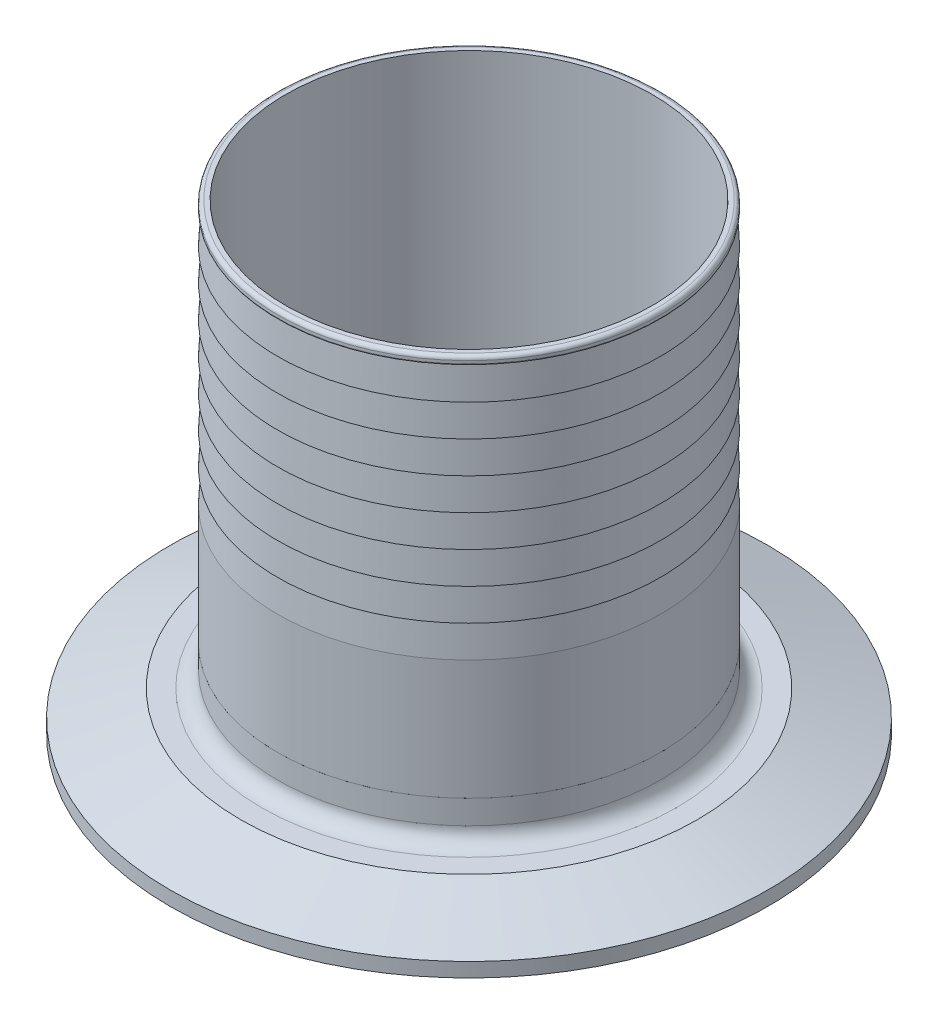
ISO-10303-21;
HEADER;
FILE_DESCRIPTION(('STEP AP214'),'2;1');
FILE_NAME('part.step','',(''),(''),'','','');
FILE_SCHEMA(('AUTOMOTIVE_DESIGN { 1 0 10303 214 1 1 1 1 }'));
ENDSEC;
DATA;
#1=APPLICATION_CONTEXT('core data for automotive mechanical design processes');
#2=APPLICATION_PROTOCOL_DEFINITION('international standard','automotive_design',2000,#1);
#3=PRODUCT_CONTEXT('',#1,'mechanical');
#4=PRODUCT('Part','Part','',(#3));
#5=PRODUCT_RELATED_PRODUCT_CATEGORY('part','',(#4));
#6=PRODUCT_DEFINITION_FORMATION('','',#4);
#7=PRODUCT_DEFINITION_CONTEXT('part definition',#1,'design');
#8=PRODUCT_DEFINITION('design','',#6,#7);
#9=PRODUCT_DEFINITION_SHAPE('','',#8);
#10=(LENGTH_UNIT() NAMED_UNIT(*) SI_UNIT(.MILLI.,.METRE.));
#11=(NAMED_UNIT(*) PLANE_ANGLE_UNIT() SI_UNIT($,.RADIAN.));
#12=(NAMED_UNIT(*) SI_UNIT($,.STERADIAN.) SOLID_ANGLE_UNIT());
#13=UNCERTAINTY_MEASURE_WITH_UNIT(LENGTH_MEASURE(1.E-05),#10,'distance_accuracy_value','');
#14=(GEOMETRIC_REPRESENTATION_CONTEXT(3) GLOBAL_UNCERTAINTY_ASSIGNED_CONTEXT((#13)) GLOBAL_UNIT_ASSIGNED_CONTEXT((#10,
#11,#12)) REPRESENTATION_CONTEXT('',''));
#15=CARTESIAN_POINT('',(0.,0.,0.));
#16=DIRECTION('',(0.,0.,1.));
#17=DIRECTION('',(1.,0.,0.));
#18=AXIS2_PLACEMENT_3D('',#15,#16,#17);
#19=CARTESIAN_POINT('',(88.170462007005,71.362430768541,112.864176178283));
#20=DIRECTION('',(0.,-0.999999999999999,0.));
#21=DIRECTION('',(0.658391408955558,0.,-0.752675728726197));
#22=AXIS2_PLACEMENT_3D('',#19,#20,#21);
#23=PLANE('',#22);
#24=CARTESIAN_POINT('',(59.4935167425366,71.3624307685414,87.7794634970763));
#25=DIRECTION('',(0.,-0.999999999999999,0.));
#26=DIRECTION('',(0.658391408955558,0.,-0.752675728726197));
#27=AXIS2_PLACEMENT_3D('',#24,#25,#26);
#28=CIRCLE('',#27,36.449);
#29=CARTESIAN_POINT('',(83.4912252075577,71.3624307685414,60.3451858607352));
#30=VERTEX_POINT('',#29);
#31=EDGE_CURVE('P0_E85',#30,#30,#28,.T.);
#32=ORIENTED_EDGE('',*,*,#31,.F.);
#33=EDGE_LOOP('',(#32));
#34=FACE_BOUND('',#33,.T.);
#35=CARTESIAN_POINT('',(59.4935167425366,71.3624307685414,87.7794634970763));
#36=DIRECTION('',(0.,-0.999999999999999,0.));
#37=DIRECTION('',(0.658391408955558,0.,-0.752675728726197));
#38=AXIS2_PLACEMENT_3D('',#35,#36,#37);
#39=CIRCLE('',#38,38.1);
#40=CARTESIAN_POINT('',(84.5782294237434,71.3624307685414,59.1025182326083));
#41=VERTEX_POINT('',#40);
#42=EDGE_CURVE('P0_E9',#41,#41,#39,.T.);
#43=ORIENTED_EDGE('',*,*,#42,.T.);
#44=EDGE_LOOP('',(#43));
#45=FACE_BOUND('',#44,.T.);
#46=ADVANCED_FACE('P0_F14',(#34,#45),#23,.T.);
#47=CARTESIAN_POINT('',(59.4935167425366,71.3624307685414,87.7794634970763));
#48=DIRECTION('',(0.,-0.999999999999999,0.));
#49=DIRECTION('',(0.658391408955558,0.,-0.752675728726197));
#50=AXIS2_PLACEMENT_3D('',#47,#48,#49);
#51=CYLINDRICAL_SURFACE('',#50,38.1);
#52=CARTESIAN_POINT('',(59.4935167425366,95.1876307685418,87.7794634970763));
#53=DIRECTION('',(0.,-0.999999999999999,0.));
#54=DIRECTION('',(0.658391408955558,0.,-0.752675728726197));
#55=AXIS2_PLACEMENT_3D('',#52,#53,#54);
#56=CIRCLE('',#55,38.1);
#57=CARTESIAN_POINT('',(84.5782294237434,95.1876307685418,59.1025182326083));
#58=VERTEX_POINT('',#57);
#59=EDGE_CURVE('P0_E20',#58,#58,#56,.T.);
#60=CARTESIAN_POINT('',(84.5782294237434,95.1876307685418,59.1025182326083));
#61=CARTESIAN_POINT('',(84.5782294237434,94.9394516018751,59.1025182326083));
#62=CARTESIAN_POINT('',(84.5782294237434,94.6912724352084,59.1025182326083));
#63=CARTESIAN_POINT('',(84.5782294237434,94.1949141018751,59.1025182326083));
#64=CARTESIAN_POINT('',(84.5782294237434,93.9467349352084,59.1025182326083));
#65=CARTESIAN_POINT('',(84.5782294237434,93.4503766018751,59.1025182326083));
#66=CARTESIAN_POINT('',(84.5782294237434,93.2021974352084,59.1025182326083));
#67=CARTESIAN_POINT('',(84.5782294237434,92.7058391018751,59.1025182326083));
#68=CARTESIAN_POINT('',(84.5782294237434,92.4576599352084,59.1025182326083));
#69=CARTESIAN_POINT('',(84.5782294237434,91.9613016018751,59.1025182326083));
#70=CARTESIAN_POINT('',(84.5782294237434,91.7131224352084,59.1025182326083));
#71=CARTESIAN_POINT('',(84.5782294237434,91.2167641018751,59.1025182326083));
#72=CARTESIAN_POINT('',(84.5782294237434,90.9685849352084,59.1025182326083));
#73=CARTESIAN_POINT('',(84.5782294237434,90.4722266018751,59.1025182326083));
#74=CARTESIAN_POINT('',(84.5782294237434,90.2240474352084,59.1025182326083));
#75=CARTESIAN_POINT('',(84.5782294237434,89.727689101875,59.1025182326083));
#76=CARTESIAN_POINT('',(84.5782294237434,89.4795099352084,59.1025182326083));
#77=CARTESIAN_POINT('',(84.5782294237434,88.983151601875,59.1025182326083));
#78=CARTESIAN_POINT('',(84.5782294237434,88.7349724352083,59.1025182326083));
#79=CARTESIAN_POINT('',(84.5782294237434,88.238614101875,59.1025182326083));
#80=CARTESIAN_POINT('',(84.5782294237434,87.9904349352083,59.1025182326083));
#81=CARTESIAN_POINT('',(84.5782294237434,87.494076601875,59.1025182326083));
#82=CARTESIAN_POINT('',(84.5782294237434,87.2458974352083,59.1025182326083));
#83=CARTESIAN_POINT('',(84.5782294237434,86.749539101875,59.1025182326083));
#84=CARTESIAN_POINT('',(84.5782294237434,86.5013599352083,59.1025182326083));
#85=CARTESIAN_POINT('',(84.5782294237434,86.005001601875,59.1025182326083));
#86=CARTESIAN_POINT('',(84.5782294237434,85.7568224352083,59.1025182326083));
#87=CARTESIAN_POINT('',(84.5782294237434,85.260464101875,59.1025182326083));
#88=CARTESIAN_POINT('',(84.5782294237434,85.0122849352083,59.1025182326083));
#89=CARTESIAN_POINT('',(84.5782294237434,84.5159266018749,59.1025182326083));
#90=CARTESIAN_POINT('',(84.5782294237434,84.2677474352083,59.1025182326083));
#91=CARTESIAN_POINT('',(84.5782294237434,83.7713891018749,59.1025182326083));
#92=CARTESIAN_POINT('',(84.5782294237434,83.5232099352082,59.1025182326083));
#93=CARTESIAN_POINT('',(84.5782294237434,83.0268516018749,59.1025182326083));
#94=CARTESIAN_POINT('',(84.5782294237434,82.7786724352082,59.1025182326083));
#95=CARTESIAN_POINT('',(84.5782294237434,82.2823141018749,59.1025182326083));
#96=CARTESIAN_POINT('',(84.5782294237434,82.0341349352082,59.1025182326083));
#97=CARTESIAN_POINT('',(84.5782294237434,81.5377766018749,59.1025182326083));
#98=CARTESIAN_POINT('',(84.5782294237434,81.2895974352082,59.1025182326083));
#99=CARTESIAN_POINT('',(84.5782294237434,80.7932391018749,59.1025182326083));
#100=CARTESIAN_POINT('',(84.5782294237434,80.5450599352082,59.1025182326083));
#101=CARTESIAN_POINT('',(84.5782294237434,80.0487016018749,59.1025182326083));
#102=CARTESIAN_POINT('',(84.5782294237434,79.8005224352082,59.1025182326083));
#103=CARTESIAN_POINT('',(84.5782294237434,79.3041641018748,59.1025182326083));
#104=CARTESIAN_POINT('',(84.5782294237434,79.0559849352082,59.1025182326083));
#105=CARTESIAN_POINT('',(84.5782294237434,78.5596266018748,59.1025182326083));
#106=CARTESIAN_POINT('',(84.5782294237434,78.3114474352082,59.1025182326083));
#107=CARTESIAN_POINT('',(84.5782294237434,77.8150891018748,59.1025182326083));
#108=CARTESIAN_POINT('',(84.5782294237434,77.5669099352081,59.1025182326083));
#109=CARTESIAN_POINT('',(84.5782294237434,77.0705516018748,59.1025182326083));
#110=CARTESIAN_POINT('',(84.5782294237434,76.8223724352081,59.1025182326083));
#111=CARTESIAN_POINT('',(84.5782294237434,76.3260141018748,59.1025182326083));
#112=CARTESIAN_POINT('',(84.5782294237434,76.0778349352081,59.1025182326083));
#113=CARTESIAN_POINT('',(84.5782294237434,75.5814766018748,59.1025182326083));
#114=CARTESIAN_POINT('',(84.5782294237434,75.3332974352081,59.1025182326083));
#115=CARTESIAN_POINT('',(84.5782294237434,74.8369391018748,59.1025182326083));
#116=CARTESIAN_POINT('',(84.5782294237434,74.5887599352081,59.1025182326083));
#117=CARTESIAN_POINT('',(84.5782294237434,74.0924016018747,59.1025182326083));
#118=CARTESIAN_POINT('',(84.5782294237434,73.8442224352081,59.1025182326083));
#119=CARTESIAN_POINT('',(84.5782294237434,73.3478641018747,59.1025182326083));
#120=CARTESIAN_POINT('',(84.5782294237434,73.0996849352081,59.1025182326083));
#121=CARTESIAN_POINT('',(84.5782294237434,72.6033266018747,59.1025182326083));
#122=CARTESIAN_POINT('',(84.5782294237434,72.355147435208,59.1025182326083));
#123=CARTESIAN_POINT('',(84.5782294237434,71.8587891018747,59.1025182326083));
#124=CARTESIAN_POINT('',(84.5782294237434,71.610609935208,59.1025182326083));
#125=CARTESIAN_POINT('',(84.5782294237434,71.3624307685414,59.1025182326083));
#126=B_SPLINE_CURVE_WITH_KNOTS('',3,(#60,#61,#62,#63,#64,#65,#66,#67,#68,#69,#70,#71,#72,#73,
#74,#75,#76,#77,#78,#79,#80,#81,#82,#83,#84,#85,#86,#87,#88,#89,#90,#91,#92,#93,#94,#95,#96,#97,
#98,#99,#100,#101,#102,#103,#104,#105,#106,#107,#108,#109,#110,#111,#112,#113,#114,#115,#116,
#117,#118,#119,#120,#121,#122,#123,#124,#125),.UNSPECIFIED.,.F.,.F.,(4,2,2,2,2,2,2,2,2,2,2,2,2,
2,2,2,2,2,2,2,2,2,2,2,2,2,2,2,2,2,2,2,4),(0.,0.744537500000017,1.48907500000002,
2.23361250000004,2.97815000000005,3.72268750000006,4.46722500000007,5.21176250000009,
5.95630000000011,6.70083750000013,7.44537500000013,8.18991250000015,8.93445000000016,
9.67898750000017,10.4235250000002,11.1680625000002,11.9126000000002,12.6571375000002,
13.4016750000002,14.1462125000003,14.8907500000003,15.6352875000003,16.3798250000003,
17.1243625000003,17.8689000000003,18.6134375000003,19.3579750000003,20.1025125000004,
20.8470500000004,21.5915875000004,22.3361250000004,23.0806625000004,23.8252000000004),.UNSPECIFIED.);
#127=EDGE_CURVE('P0_BSEAM101',#58,#41,#126,.T.);
#128=ORIENTED_EDGE('',*,*,#59,.T.);
#129=ORIENTED_EDGE('',*,*,#42,.F.);
#130=ORIENTED_EDGE('',*,*,#127,.T.);
#131=ORIENTED_EDGE('',*,*,#127,.F.);
#132=EDGE_LOOP('',(#128,#130,#129,#131));
#133=FACE_BOUND('',#132,.T.);
#134=ADVANCED_FACE('P0_F101',(#133),#51,.T.);
#135=CARTESIAN_POINT('',(59.4935167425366,95.1876307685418,87.7794634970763));
#136=DIRECTION('',(0.,-0.999999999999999,0.));
#137=DIRECTION('',(0.658391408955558,0.,-0.752675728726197));
#138=AXIS2_PLACEMENT_3D('',#135,#136,#137);
#139=CONICAL_SURFACE('',#138,38.1,0.0599281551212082);
#140=CARTESIAN_POINT('',(59.4935167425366,101.537630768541,87.7794634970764));
#141=DIRECTION('',(0.,-0.999999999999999,0.));
#142=DIRECTION('',(0.658391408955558,0.,-0.752675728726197));
#143=AXIS2_PLACEMENT_3D('',#140,#141,#142);
#144=CIRCLE('',#143,37.719);
#145=CARTESIAN_POINT('',(84.3273822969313,101.537630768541,59.3892876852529));
#146=VERTEX_POINT('',#145);
#147=EDGE_CURVE('P0_E24',#146,#146,#144,.T.);
#148=CARTESIAN_POINT('',(84.3273822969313,101.537630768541,59.3892876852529));
#149=CARTESIAN_POINT('',(84.3299952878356,101.471484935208,59.3863005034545));
#150=CARTESIAN_POINT('',(84.3326082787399,101.405339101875,59.3833133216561));
#151=CARTESIAN_POINT('',(84.3378342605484,101.273047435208,59.3773389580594));
#152=CARTESIAN_POINT('',(84.3404472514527,101.206901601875,59.374351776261));
#153=CARTESIAN_POINT('',(84.3456732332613,101.074609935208,59.3683774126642));
#154=CARTESIAN_POINT('',(84.3482862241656,101.008464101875,59.3653902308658));
#155=CARTESIAN_POINT('',(84.3535122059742,100.876172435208,59.3594158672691));
#156=CARTESIAN_POINT('',(84.3561251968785,100.810026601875,59.3564286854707));
#157=CARTESIAN_POINT('',(84.3613511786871,100.677734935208,59.3504543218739));
#158=CARTESIAN_POINT('',(84.3639641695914,100.611589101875,59.3474671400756));
#159=CARTESIAN_POINT('',(84.3691901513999,100.479297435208,59.3414927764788));
#160=CARTESIAN_POINT('',(84.3718031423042,100.413151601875,59.3385055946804));
#161=CARTESIAN_POINT('',(84.3770291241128,100.280859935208,59.3325312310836));
#162=CARTESIAN_POINT('',(84.3796421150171,100.214714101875,59.3295440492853));
#163=CARTESIAN_POINT('',(84.3848680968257,100.082422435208,59.3235696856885));
#164=CARTESIAN_POINT('',(84.38748108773,100.016276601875,59.3205825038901));
#165=CARTESIAN_POINT('',(84.3927070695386,99.883984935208,59.3146081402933));
#166=CARTESIAN_POINT('',(84.3953200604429,99.8178391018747,59.311620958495));
#167=CARTESIAN_POINT('',(84.4005460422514,99.6855474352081,59.3056465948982));
#168=CARTESIAN_POINT('',(84.4031590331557,99.6194016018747,59.3026594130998));
#169=CARTESIAN_POINT('',(84.4083850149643,99.4871099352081,59.296685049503));
#170=CARTESIAN_POINT('',(84.4109980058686,99.4209641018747,59.2936978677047));
#171=CARTESIAN_POINT('',(84.4162239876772,99.2886724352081,59.2877235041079));
#172=CARTESIAN_POINT('',(84.4188369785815,99.2225266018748,59.2847363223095));
#173=CARTESIAN_POINT('',(84.4240629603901,99.0902349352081,59.2787619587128));
#174=CARTESIAN_POINT('',(84.4266759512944,99.0240891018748,59.2757747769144));
#175=CARTESIAN_POINT('',(84.431901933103,98.8917974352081,59.2698004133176));
#176=CARTESIAN_POINT('',(84.4345149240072,98.8256516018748,59.2668132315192));
#177=CARTESIAN_POINT('',(84.4397409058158,98.6933599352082,59.2608388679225));
#178=CARTESIAN_POINT('',(84.4423538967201,98.6272141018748,59.2578516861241));
#179=CARTESIAN_POINT('',(84.4475798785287,98.4949224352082,59.2518773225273));
#180=CARTESIAN_POINT('',(84.450192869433,98.4287766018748,59.2488901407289));
#181=CARTESIAN_POINT('',(84.4554188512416,98.2964849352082,59.2429157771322));
#182=CARTESIAN_POINT('',(84.4580318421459,98.2303391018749,59.2399285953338));
#183=CARTESIAN_POINT('',(84.4632578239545,98.0980474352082,59.233954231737));
#184=CARTESIAN_POINT('',(84.4658708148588,98.0319016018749,59.2309670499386));
#185=CARTESIAN_POINT('',(84.4710967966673,97.8996099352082,59.2249926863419));
#186=CARTESIAN_POINT('',(84.4737097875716,97.8334641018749,59.2220055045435));
#187=CARTESIAN_POINT('',(84.4789357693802,97.7011724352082,59.2160311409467));
#188=CARTESIAN_POINT('',(84.4815487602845,97.6350266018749,59.2130439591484));
#189=CARTESIAN_POINT('',(84.4867747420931,97.5027349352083,59.2070695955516));
#190=CARTESIAN_POINT('',(84.4893877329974,97.4365891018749,59.2040824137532));
#191=CARTESIAN_POINT('',(84.494613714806,97.3042974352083,59.1981080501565));
#192=CARTESIAN_POINT('',(84.4972267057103,97.2381516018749,59.1951208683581));
#193=CARTESIAN_POINT('',(84.5024526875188,97.1058599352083,59.1891465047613));
#194=CARTESIAN_POINT('',(84.5050656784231,97.039714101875,59.1861593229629));
#195=CARTESIAN_POINT('',(84.5102916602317,96.9074224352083,59.1801849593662));
#196=CARTESIAN_POINT('',(84.512904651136,96.841276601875,59.1771977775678));
#197=CARTESIAN_POINT('',(84.5181306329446,96.7089849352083,59.171223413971));
#198=CARTESIAN_POINT('',(84.5207436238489,96.642839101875,59.1682362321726));
#199=CARTESIAN_POINT('',(84.5259696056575,96.5105474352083,59.1622618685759));
#200=CARTESIAN_POINT('',(84.5285825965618,96.444401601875,59.1592746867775));
#201=CARTESIAN_POINT('',(84.5338085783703,96.3121099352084,59.1533003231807));
#202=CARTESIAN_POINT('',(84.5364215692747,96.245964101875,59.1503131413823));
#203=CARTESIAN_POINT('',(84.5416475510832,96.1136724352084,59.1443387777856));
#204=CARTESIAN_POINT('',(84.5442605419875,96.0475266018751,59.1413515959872));
#205=CARTESIAN_POINT('',(84.5494865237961,95.9152349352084,59.1353772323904));
#206=CARTESIAN_POINT('',(84.5520995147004,95.8490891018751,59.1323900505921));
#207=CARTESIAN_POINT('',(84.557325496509,95.7167974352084,59.1264156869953));
#208=CARTESIAN_POINT('',(84.5599384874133,95.6506516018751,59.1234285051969));
#209=CARTESIAN_POINT('',(84.5651644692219,95.5183599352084,59.1174541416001));
#210=CARTESIAN_POINT('',(84.5677774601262,95.4522141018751,59.1144669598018));
#211=CARTESIAN_POINT('',(84.5730034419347,95.3199224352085,59.108492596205));
#212=CARTESIAN_POINT('',(84.575616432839,95.2537766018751,59.1055054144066));
#213=CARTESIAN_POINT('',(84.5782294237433,95.1876307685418,59.1025182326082));
#214=B_SPLINE_CURVE_WITH_KNOTS('',3,(#148,#149,#150,#151,#152,#153,#154,#155,#156,#157,#158,
#159,#160,#161,#162,#163,#164,#165,#166,#167,#168,#169,#170,#171,#172,#173,#174,#175,#176,#177,
#178,#179,#180,#181,#182,#183,#184,#185,#186,#187,#188,#189,#190,#191,#192,#193,#194,#195,#196,
#197,#198,#199,#200,#201,#202,#203,#204,#205,#206,#207,#208,#209,#210,#211,#212,#213),
.UNSPECIFIED.,.F.,.F.,(4,2,2,2,2,2,2,2,2,2,2,2,2,2,2,2,2,2,2,2,2,2,2,2,2,2,2,2,2,2,2,2,4),(0.,
0.198794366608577,0.397588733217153,0.59638309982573,0.795177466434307,0.993971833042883,
1.19276619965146,1.39156056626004,1.59035493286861,1.78914929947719,1.98794366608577,
2.18673803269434,2.38553239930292,2.5843267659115,2.78312113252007,2.98191549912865,
3.18070986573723,3.3795042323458,3.57829859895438,3.77709296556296,3.97588733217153,
4.17468169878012,4.37347606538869,4.57227043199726,4.77106479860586,4.96985916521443,
5.168653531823,5.36744789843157,5.56624226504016,5.76503663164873,5.9638309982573,
6.16262536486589,6.36141973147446),.UNSPECIFIED.);
#215=EDGE_CURVE('P0_BSEAM106',#146,#58,#214,.T.);
#216=ORIENTED_EDGE('',*,*,#147,.T.);
#217=ORIENTED_EDGE('',*,*,#59,.F.);
#218=ORIENTED_EDGE('',*,*,#215,.T.);
#219=ORIENTED_EDGE('',*,*,#215,.F.);
#220=EDGE_LOOP('',(#216,#218,#217,#219));
#221=FACE_BOUND('',#220,.T.);
#222=ADVANCED_FACE('P0_F106',(#221),#139,.T.);
#223=CARTESIAN_POINT('',(88.1704620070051,101.537630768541,112.864176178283));
#224=DIRECTION('',(0.,-0.999999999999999,0.));
#225=DIRECTION('',(0.658391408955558,0.,-0.752675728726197));
#226=AXIS2_PLACEMENT_3D('',#223,#224,#225);
#227=PLANE('',#226);
#228=CARTESIAN_POINT('',(59.4935167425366,101.537630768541,87.7794634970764));
#229=DIRECTION('',(0.,-0.999999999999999,0.));
#230=DIRECTION('',(0.658391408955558,0.,-0.752675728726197));
#231=AXIS2_PLACEMENT_3D('',#228,#229,#230);
#232=CIRCLE('',#231,38.1);
#233=CARTESIAN_POINT('',(84.5782294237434,101.537630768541,59.1025182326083));
#234=VERTEX_POINT('',#233);
#235=EDGE_CURVE('P0_E28',#234,#234,#232,.T.);
#236=ORIENTED_EDGE('',*,*,#235,.T.);
#237=EDGE_LOOP('',(#236));
#238=FACE_BOUND('',#237,.T.);
#239=ORIENTED_EDGE('',*,*,#147,.F.);
#240=EDGE_LOOP('',(#239));
#241=FACE_BOUND('',#240,.T.);
#242=ADVANCED_FACE('P0_F110',(#238,#241),#227,.T.);
#243=CARTESIAN_POINT('',(59.4935167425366,101.537630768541,87.7794634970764));
#244=DIRECTION('',(0.,-0.999999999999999,0.));
#245=DIRECTION('',(0.658391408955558,0.,-0.752675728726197));
#246=AXIS2_PLACEMENT_3D('',#243,#244,#245);
#247=CONICAL_SURFACE('',#246,38.1,0.0599281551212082);
#248=CARTESIAN_POINT('',(59.4935167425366,107.887630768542,87.7794634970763));
#249=DIRECTION('',(0.,-0.999999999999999,0.));
#250=DIRECTION('',(0.658391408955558,0.,-0.752675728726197));
#251=AXIS2_PLACEMENT_3D('',#248,#249,#250);
#252=CIRCLE('',#251,37.719);
#253=CARTESIAN_POINT('',(84.3273822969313,107.887630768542,59.389287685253));
#254=VERTEX_POINT('',#253);
#255=EDGE_CURVE('P0_E33',#254,#254,#252,.T.);
#256=CARTESIAN_POINT('',(84.3273822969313,107.887630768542,59.389287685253));
#257=CARTESIAN_POINT('',(84.3299952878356,107.821484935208,59.3863005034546));
#258=CARTESIAN_POINT('',(84.3326082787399,107.755339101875,59.3833133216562));
#259=CARTESIAN_POINT('',(84.3378342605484,107.623047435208,59.3773389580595));
#260=CARTESIAN_POINT('',(84.3404472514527,107.556901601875,59.3743517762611));
#261=CARTESIAN_POINT('',(84.3456732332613,107.424609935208,59.3683774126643));
#262=CARTESIAN_POINT('',(84.3482862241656,107.358464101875,59.3653902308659));
#263=CARTESIAN_POINT('',(84.3535122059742,107.226172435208,59.3594158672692));
#264=CARTESIAN_POINT('',(84.3561251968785,107.160026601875,59.3564286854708));
#265=CARTESIAN_POINT('',(84.3613511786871,107.027734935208,59.350454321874));
#266=CARTESIAN_POINT('',(84.3639641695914,106.961589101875,59.3474671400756));
#267=CARTESIAN_POINT('',(84.3691901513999,106.829297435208,59.3414927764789));
#268=CARTESIAN_POINT('',(84.3718031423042,106.763151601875,59.3385055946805));
#269=CARTESIAN_POINT('',(84.3770291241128,106.630859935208,59.3325312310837));
#270=CARTESIAN_POINT('',(84.3796421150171,106.564714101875,59.3295440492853));
#271=CARTESIAN_POINT('',(84.3848680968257,106.432422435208,59.3235696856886));
#272=CARTESIAN_POINT('',(84.38748108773,106.366276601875,59.3205825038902));
#273=CARTESIAN_POINT('',(84.3927070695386,106.233984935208,59.3146081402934));
#274=CARTESIAN_POINT('',(84.3953200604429,106.167839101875,59.311620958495));
#275=CARTESIAN_POINT('',(84.4005460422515,106.035547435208,59.3056465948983));
#276=CARTESIAN_POINT('',(84.4031590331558,105.969401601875,59.3026594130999));
#277=CARTESIAN_POINT('',(84.4083850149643,105.837109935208,59.2966850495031));
#278=CARTESIAN_POINT('',(84.4109980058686,105.770964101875,59.2936978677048));
#279=CARTESIAN_POINT('',(84.4162239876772,105.638672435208,59.287723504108));
#280=CARTESIAN_POINT('',(84.4188369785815,105.572526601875,59.2847363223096));
#281=CARTESIAN_POINT('',(84.4240629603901,105.440234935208,59.2787619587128));
#282=CARTESIAN_POINT('',(84.4266759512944,105.374089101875,59.2757747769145));
#283=CARTESIAN_POINT('',(84.431901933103,105.241797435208,59.2698004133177));
#284=CARTESIAN_POINT('',(84.4345149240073,105.175651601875,59.2668132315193));
#285=CARTESIAN_POINT('',(84.4397409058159,105.043359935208,59.2608388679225));
#286=CARTESIAN_POINT('',(84.4423538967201,104.977214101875,59.2578516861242));
#287=CARTESIAN_POINT('',(84.4475798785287,104.844922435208,59.2518773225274));
#288=CARTESIAN_POINT('',(84.450192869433,104.778776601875,59.248890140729));
#289=CARTESIAN_POINT('',(84.4554188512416,104.646484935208,59.2429157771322));
#290=CARTESIAN_POINT('',(84.4580318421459,104.580339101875,59.2399285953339));
#291=CARTESIAN_POINT('',(84.4632578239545,104.448047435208,59.2339542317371));
#292=CARTESIAN_POINT('',(84.4658708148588,104.381901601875,59.2309670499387));
#293=CARTESIAN_POINT('',(84.4710967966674,104.249609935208,59.224992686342));
#294=CARTESIAN_POINT('',(84.4737097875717,104.183464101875,59.2220055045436));
#295=CARTESIAN_POINT('',(84.4789357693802,104.051172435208,59.2160311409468));
#296=CARTESIAN_POINT('',(84.4815487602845,103.985026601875,59.2130439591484));
#297=CARTESIAN_POINT('',(84.4867747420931,103.852734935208,59.2070695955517));
#298=CARTESIAN_POINT('',(84.4893877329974,103.786589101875,59.2040824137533));
#299=CARTESIAN_POINT('',(84.494613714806,103.654297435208,59.1981080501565));
#300=CARTESIAN_POINT('',(84.4972267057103,103.588151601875,59.1951208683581));
#301=CARTESIAN_POINT('',(84.5024526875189,103.455859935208,59.1891465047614));
#302=CARTESIAN_POINT('',(84.5050656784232,103.389714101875,59.186159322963));
#303=CARTESIAN_POINT('',(84.5102916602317,103.257422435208,59.1801849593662));
#304=CARTESIAN_POINT('',(84.5129046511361,103.191276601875,59.1771977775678));
#305=CARTESIAN_POINT('',(84.5181306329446,103.058984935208,59.1712234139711));
#306=CARTESIAN_POINT('',(84.5207436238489,102.992839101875,59.1682362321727));
#307=CARTESIAN_POINT('',(84.5259696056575,102.860547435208,59.1622618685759));
#308=CARTESIAN_POINT('',(84.5285825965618,102.794401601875,59.1592746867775));
#309=CARTESIAN_POINT('',(84.5338085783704,102.662109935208,59.1533003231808));
#310=CARTESIAN_POINT('',(84.5364215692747,102.595964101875,59.1503131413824));
#311=CARTESIAN_POINT('',(84.5416475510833,102.463672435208,59.1443387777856));
#312=CARTESIAN_POINT('',(84.5442605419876,102.397526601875,59.1413515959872));
#313=CARTESIAN_POINT('',(84.5494865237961,102.265234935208,59.1353772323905));
#314=CARTESIAN_POINT('',(84.5520995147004,102.199089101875,59.1323900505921));
#315=CARTESIAN_POINT('',(84.557325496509,102.066797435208,59.1264156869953));
#316=CARTESIAN_POINT('',(84.5599384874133,102.000651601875,59.123428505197));
#317=CARTESIAN_POINT('',(84.5651644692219,101.868359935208,59.1174541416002));
#318=CARTESIAN_POINT('',(84.5677774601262,101.802214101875,59.1144669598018));
#319=CARTESIAN_POINT('',(84.5730034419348,101.669922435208,59.108492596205));
#320=CARTESIAN_POINT('',(84.5756164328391,101.603776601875,59.1055054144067));
#321=CARTESIAN_POINT('',(84.5782294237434,101.537630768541,59.1025182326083));
#322=B_SPLINE_CURVE_WITH_KNOTS('',3,(#256,#257,#258,#259,#260,#261,#262,#263,#264,#265,#266,
#267,#268,#269,#270,#271,#272,#273,#274,#275,#276,#277,#278,#279,#280,#281,#282,#283,#284,#285,
#286,#287,#288,#289,#290,#291,#292,#293,#294,#295,#296,#297,#298,#299,#300,#301,#302,#303,#304,
#305,#306,#307,#308,#309,#310,#311,#312,#313,#314,#315,#316,#317,#318,#319,#320,#321),
.UNSPECIFIED.,.F.,.F.,(4,2,2,2,2,2,2,2,2,2,2,2,2,2,2,2,2,2,2,2,2,2,2,2,2,2,2,2,2,2,2,2,4),(0.,
0.198794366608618,0.397588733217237,0.596383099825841,0.795177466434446,0.993971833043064,
1.19276619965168,1.39156056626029,1.59035493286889,1.78914929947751,1.98794366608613,
2.18673803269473,2.38553239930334,2.58432676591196,2.78312113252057,2.98191549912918,
3.18070986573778,3.3795042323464,3.57829859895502,3.77709296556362,3.97588733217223,
4.17468169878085,4.37347606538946,4.57227043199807,4.77106479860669,4.96985916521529,
5.1686535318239,5.36744789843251,5.56624226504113,5.76503663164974,5.96383099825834,
6.16262536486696,6.36141973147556),.UNSPECIFIED.);
#323=EDGE_CURVE('P0_BSEAM117',#254,#234,#322,.T.);
#324=ORIENTED_EDGE('',*,*,#255,.T.);
#325=ORIENTED_EDGE('',*,*,#235,.F.);
#326=ORIENTED_EDGE('',*,*,#323,.T.);
#327=ORIENTED_EDGE('',*,*,#323,.F.);
#328=EDGE_LOOP('',(#324,#326,#325,#327));
#329=FACE_BOUND('',#328,.T.);
#330=ADVANCED_FACE('P0_F117',(#329),#247,.T.);
#331=CARTESIAN_POINT('',(88.1704620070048,107.887630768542,112.864176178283));
#332=DIRECTION('',(0.,-0.999999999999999,0.));
#333=DIRECTION('',(0.658391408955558,0.,-0.752675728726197));
#334=AXIS2_PLACEMENT_3D('',#331,#332,#333);
#335=PLANE('',#334);
#336=CARTESIAN_POINT('',(59.4935167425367,107.887630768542,87.7794634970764));
#337=DIRECTION('',(0.,-0.999999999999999,0.));
#338=DIRECTION('',(0.658391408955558,0.,-0.752675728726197));
#339=AXIS2_PLACEMENT_3D('',#336,#337,#338);
#340=CIRCLE('',#339,38.1);
#341=CARTESIAN_POINT('',(84.5782294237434,107.887630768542,59.1025182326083));
#342=VERTEX_POINT('',#341);
#343=EDGE_CURVE('P0_E36',#342,#342,#340,.T.);
#344=ORIENTED_EDGE('',*,*,#343,.T.);
#345=EDGE_LOOP('',(#344));
#346=FACE_BOUND('',#345,.T.);
#347=ORIENTED_EDGE('',*,*,#255,.F.);
#348=EDGE_LOOP('',(#347));
#349=FACE_BOUND('',#348,.T.);
#350=ADVANCED_FACE('P0_F121',(#346,#349),#335,.T.);
#351=CARTESIAN_POINT('',(59.4935167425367,107.887630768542,87.7794634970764));
#352=DIRECTION('',(0.,-0.999999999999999,0.));
#353=DIRECTION('',(0.658391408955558,0.,-0.752675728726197));
#354=AXIS2_PLACEMENT_3D('',#351,#352,#353);
#355=CONICAL_SURFACE('',#354,38.1,0.0599281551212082);
#356=CARTESIAN_POINT('',(59.4935167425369,114.237630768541,87.7794634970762));
#357=DIRECTION('',(0.,-0.999999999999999,0.));
#358=DIRECTION('',(0.658391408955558,0.,-0.752675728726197));
#359=AXIS2_PLACEMENT_3D('',#356,#357,#358);
#360=CIRCLE('',#359,37.719);
#361=CARTESIAN_POINT('',(84.3273822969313,114.237630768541,59.389287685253));
#362=VERTEX_POINT('',#361);
#363=EDGE_CURVE('P0_E39',#362,#362,#360,.T.);
#364=CARTESIAN_POINT('',(84.3273822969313,114.237630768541,59.389287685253));
#365=CARTESIAN_POINT('',(84.3299952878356,114.171484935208,59.3863005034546));
#366=CARTESIAN_POINT('',(84.3326082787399,114.105339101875,59.3833133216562));
#367=CARTESIAN_POINT('',(84.3378342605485,113.973047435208,59.3773389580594));
#368=CARTESIAN_POINT('',(84.3404472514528,113.906901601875,59.3743517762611));
#369=CARTESIAN_POINT('',(84.3456732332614,113.774609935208,59.3683774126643));
#370=CARTESIAN_POINT('',(84.3482862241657,113.708464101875,59.3653902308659));
#371=CARTESIAN_POINT('',(84.3535122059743,113.576172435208,59.3594158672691));
#372=CARTESIAN_POINT('',(84.3561251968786,113.510026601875,59.3564286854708));
#373=CARTESIAN_POINT('',(84.3613511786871,113.377734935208,59.350454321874));
#374=CARTESIAN_POINT('',(84.3639641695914,113.311589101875,59.3474671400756));
#375=CARTESIAN_POINT('',(84.3691901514,113.179297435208,59.3414927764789));
#376=CARTESIAN_POINT('',(84.3718031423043,113.113151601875,59.3385055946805));
#377=CARTESIAN_POINT('',(84.3770291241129,112.980859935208,59.3325312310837));
#378=CARTESIAN_POINT('',(84.3796421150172,112.914714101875,59.3295440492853));
#379=CARTESIAN_POINT('',(84.3848680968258,112.782422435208,59.3235696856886));
#380=CARTESIAN_POINT('',(84.3874810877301,112.716276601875,59.3205825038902));
#381=CARTESIAN_POINT('',(84.3927070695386,112.583984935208,59.3146081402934));
#382=CARTESIAN_POINT('',(84.395320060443,112.517839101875,59.311620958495));
#383=CARTESIAN_POINT('',(84.4005460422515,112.385547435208,59.3056465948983));
#384=CARTESIAN_POINT('',(84.4031590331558,112.319401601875,59.3026594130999));
#385=CARTESIAN_POINT('',(84.4083850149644,112.187109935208,59.2966850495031));
#386=CARTESIAN_POINT('',(84.4109980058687,112.120964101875,59.2936978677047));
#387=CARTESIAN_POINT('',(84.4162239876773,111.988672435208,59.287723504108));
#388=CARTESIAN_POINT('',(84.4188369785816,111.922526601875,59.2847363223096));
#389=CARTESIAN_POINT('',(84.4240629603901,111.790234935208,59.2787619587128));
#390=CARTESIAN_POINT('',(84.4266759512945,111.724089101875,59.2757747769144));
#391=CARTESIAN_POINT('',(84.431901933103,111.591797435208,59.2698004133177));
#392=CARTESIAN_POINT('',(84.4345149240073,111.525651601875,59.2668132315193));
#393=CARTESIAN_POINT('',(84.4397409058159,111.393359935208,59.2608388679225));
#394=CARTESIAN_POINT('',(84.4423538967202,111.327214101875,59.2578516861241));
#395=CARTESIAN_POINT('',(84.4475798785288,111.194922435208,59.2518773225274));
#396=CARTESIAN_POINT('',(84.4501928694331,111.128776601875,59.248890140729));
#397=CARTESIAN_POINT('',(84.4554188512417,110.996484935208,59.2429157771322));
#398=CARTESIAN_POINT('',(84.458031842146,110.930339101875,59.2399285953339));
#399=CARTESIAN_POINT('',(84.4632578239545,110.798047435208,59.2339542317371));
#400=CARTESIAN_POINT('',(84.4658708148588,110.731901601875,59.2309670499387));
#401=CARTESIAN_POINT('',(84.4710967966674,110.599609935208,59.224992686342));
#402=CARTESIAN_POINT('',(84.4737097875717,110.533464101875,59.2220055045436));
#403=CARTESIAN_POINT('',(84.4789357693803,110.401172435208,59.2160311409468));
#404=CARTESIAN_POINT('',(84.4815487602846,110.335026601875,59.2130439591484));
#405=CARTESIAN_POINT('',(84.4867747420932,110.202734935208,59.2070695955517));
#406=CARTESIAN_POINT('',(84.4893877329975,110.136589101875,59.2040824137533));
#407=CARTESIAN_POINT('',(84.4946137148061,110.004297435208,59.1981080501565));
#408=CARTESIAN_POINT('',(84.4972267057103,109.938151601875,59.1951208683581));
#409=CARTESIAN_POINT('',(84.5024526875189,109.805859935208,59.1891465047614));
#410=CARTESIAN_POINT('',(84.5050656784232,109.739714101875,59.186159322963));
#411=CARTESIAN_POINT('',(84.5102916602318,109.607422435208,59.1801849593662));
#412=CARTESIAN_POINT('',(84.5129046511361,109.541276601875,59.1771977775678));
#413=CARTESIAN_POINT('',(84.5181306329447,109.408984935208,59.1712234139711));
#414=CARTESIAN_POINT('',(84.520743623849,109.342839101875,59.1682362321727));
#415=CARTESIAN_POINT('',(84.5259696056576,109.210547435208,59.1622618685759));
#416=CARTESIAN_POINT('',(84.5285825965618,109.144401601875,59.1592746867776));
#417=CARTESIAN_POINT('',(84.5338085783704,109.012109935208,59.1533003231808));
#418=CARTESIAN_POINT('',(84.5364215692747,108.945964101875,59.1503131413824));
#419=CARTESIAN_POINT('',(84.5416475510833,108.813672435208,59.1443387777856));
#420=CARTESIAN_POINT('',(84.5442605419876,108.747526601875,59.1413515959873));
#421=CARTESIAN_POINT('',(84.5494865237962,108.615234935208,59.1353772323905));
#422=CARTESIAN_POINT('',(84.5520995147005,108.549089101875,59.1323900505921));
#423=CARTESIAN_POINT('',(84.5573254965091,108.416797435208,59.1264156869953));
#424=CARTESIAN_POINT('',(84.5599384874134,108.350651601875,59.123428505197));
#425=CARTESIAN_POINT('',(84.5651644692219,108.218359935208,59.1174541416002));
#426=CARTESIAN_POINT('',(84.5677774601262,108.152214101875,59.1144669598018));
#427=CARTESIAN_POINT('',(84.5730034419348,108.019922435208,59.108492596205));
#428=CARTESIAN_POINT('',(84.5756164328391,107.953776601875,59.1055054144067));
#429=CARTESIAN_POINT('',(84.5782294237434,107.887630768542,59.1025182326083));
#430=B_SPLINE_CURVE_WITH_KNOTS('',3,(#364,#365,#366,#367,#368,#369,#370,#371,#372,#373,#374,
#375,#376,#377,#378,#379,#380,#381,#382,#383,#384,#385,#386,#387,#388,#389,#390,#391,#392,#393,
#394,#395,#396,#397,#398,#399,#400,#401,#402,#403,#404,#405,#406,#407,#408,#409,#410,#411,#412,
#413,#414,#415,#416,#417,#418,#419,#420,#421,#422,#423,#424,#425,#426,#427,#428,#429),
.UNSPECIFIED.,.F.,.F.,(4,2,2,2,2,2,2,2,2,2,2,2,2,2,2,2,2,2,2,2,2,2,2,2,2,2,2,2,2,2,2,2,4),(0.,
0.19879436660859,0.397588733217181,0.596383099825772,0.795177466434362,0.993971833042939,
1.19276619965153,1.39156056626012,1.5903549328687,1.78914929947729,1.98794366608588,
2.18673803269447,2.38553239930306,2.58432676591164,2.78312113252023,2.98191549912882,
3.18070986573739,3.37950423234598,3.57829859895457,3.77709296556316,3.97588733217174,
4.17468169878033,4.37347606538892,4.57227043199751,4.7710647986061,4.96985916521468,
5.16865353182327,5.36744789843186,5.56624226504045,5.76503663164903,5.96383099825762,
6.16262536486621,6.36141973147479),.UNSPECIFIED.);
#431=EDGE_CURVE('P0_BSEAM125',#362,#342,#430,.T.);
#432=ORIENTED_EDGE('',*,*,#363,.T.);
#433=ORIENTED_EDGE('',*,*,#343,.F.);
#434=ORIENTED_EDGE('',*,*,#431,.T.);
#435=ORIENTED_EDGE('',*,*,#431,.F.);
#436=EDGE_LOOP('',(#432,#434,#433,#435));
#437=FACE_BOUND('',#436,.T.);
#438=ADVANCED_FACE('P0_F125',(#437),#355,.T.);
#439=CARTESIAN_POINT('',(88.1704620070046,114.237630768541,112.864176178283));
#440=DIRECTION('',(0.,-0.999999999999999,0.));
#441=DIRECTION('',(0.658391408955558,0.,-0.752675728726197));
#442=AXIS2_PLACEMENT_3D('',#439,#440,#441);
#443=PLANE('',#442);
#444=CARTESIAN_POINT('',(59.493516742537,114.237630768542,87.7794634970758));
#445=DIRECTION('',(0.,-0.999999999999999,0.));
#446=DIRECTION('',(0.658391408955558,0.,-0.752675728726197));
#447=AXIS2_PLACEMENT_3D('',#444,#445,#446);
#448=CIRCLE('',#447,38.1);
#449=CARTESIAN_POINT('',(84.5782294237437,114.237630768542,59.1025182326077));
#450=VERTEX_POINT('',#449);
#451=EDGE_CURVE('P0_E42',#450,#450,#448,.T.);
#452=ORIENTED_EDGE('',*,*,#451,.T.);
#453=EDGE_LOOP('',(#452));
#454=FACE_BOUND('',#453,.T.);
#455=ORIENTED_EDGE('',*,*,#363,.F.);
#456=EDGE_LOOP('',(#455));
#457=FACE_BOUND('',#456,.T.);
#458=ADVANCED_FACE('P0_F129',(#454,#457),#443,.T.);
#459=CARTESIAN_POINT('',(59.493516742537,114.237630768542,87.7794634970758));
#460=DIRECTION('',(0.,-0.999999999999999,0.));
#461=DIRECTION('',(0.658391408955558,0.,-0.752675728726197));
#462=AXIS2_PLACEMENT_3D('',#459,#460,#461);
#463=CONICAL_SURFACE('',#462,38.1,0.0599281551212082);
#464=CARTESIAN_POINT('',(59.4935167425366,120.587630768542,87.7794634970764));
#465=DIRECTION('',(0.,-0.999999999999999,0.));
#466=DIRECTION('',(0.658391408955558,0.,-0.752675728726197));
#467=AXIS2_PLACEMENT_3D('',#464,#465,#466);
#468=CIRCLE('',#467,37.719);
#469=CARTESIAN_POINT('',(84.3273822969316,120.587630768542,59.3892876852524));
#470=VERTEX_POINT('',#469);
#471=EDGE_CURVE('P0_E45',#470,#470,#468,.T.);
#472=CARTESIAN_POINT('',(84.3273822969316,120.587630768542,59.3892876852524));
#473=CARTESIAN_POINT('',(84.3299952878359,120.521484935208,59.3863005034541));
#474=CARTESIAN_POINT('',(84.3326082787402,120.455339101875,59.3833133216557));
#475=CARTESIAN_POINT('',(84.3378342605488,120.323047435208,59.3773389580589));
#476=CARTESIAN_POINT('',(84.3404472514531,120.256901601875,59.3743517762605));
#477=CARTESIAN_POINT('',(84.3456732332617,120.124609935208,59.3683774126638));
#478=CARTESIAN_POINT('',(84.348286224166,120.058464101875,59.3653902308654));
#479=CARTESIAN_POINT('',(84.3535122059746,119.926172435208,59.3594158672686));
#480=CARTESIAN_POINT('',(84.3561251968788,119.860026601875,59.3564286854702));
#481=CARTESIAN_POINT('',(84.3613511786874,119.727734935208,59.3504543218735));
#482=CARTESIAN_POINT('',(84.3639641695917,119.661589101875,59.3474671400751));
#483=CARTESIAN_POINT('',(84.3691901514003,119.529297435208,59.3414927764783));
#484=CARTESIAN_POINT('',(84.3718031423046,119.463151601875,59.3385055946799));
#485=CARTESIAN_POINT('',(84.3770291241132,119.330859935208,59.3325312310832));
#486=CARTESIAN_POINT('',(84.3796421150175,119.264714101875,59.3295440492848));
#487=CARTESIAN_POINT('',(84.3848680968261,119.132422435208,59.323569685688));
#488=CARTESIAN_POINT('',(84.3874810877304,119.066276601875,59.3205825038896));
#489=CARTESIAN_POINT('',(84.3927070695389,118.933984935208,59.3146081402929));
#490=CARTESIAN_POINT('',(84.3953200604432,118.867839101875,59.3116209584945));
#491=CARTESIAN_POINT('',(84.4005460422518,118.735547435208,59.3056465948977));
#492=CARTESIAN_POINT('',(84.4031590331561,118.669401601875,59.3026594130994));
#493=CARTESIAN_POINT('',(84.4083850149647,118.537109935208,59.2966850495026));
#494=CARTESIAN_POINT('',(84.410998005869,118.470964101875,59.2936978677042));
#495=CARTESIAN_POINT('',(84.4162239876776,118.338672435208,59.2877235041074));
#496=CARTESIAN_POINT('',(84.4188369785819,118.272526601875,59.2847363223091));
#497=CARTESIAN_POINT('',(84.4240629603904,118.140234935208,59.2787619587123));
#498=CARTESIAN_POINT('',(84.4266759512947,118.074089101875,59.2757747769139));
#499=CARTESIAN_POINT('',(84.4319019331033,117.941797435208,59.2698004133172));
#500=CARTESIAN_POINT('',(84.4345149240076,117.875651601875,59.2668132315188));
#501=CARTESIAN_POINT('',(84.4397409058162,117.743359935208,59.260838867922));
#502=CARTESIAN_POINT('',(84.4423538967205,117.677214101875,59.2578516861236));
#503=CARTESIAN_POINT('',(84.4475798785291,117.544922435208,59.2518773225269));
#504=CARTESIAN_POINT('',(84.4501928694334,117.478776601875,59.2488901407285));
#505=CARTESIAN_POINT('',(84.455418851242,117.346484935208,59.2429157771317));
#506=CARTESIAN_POINT('',(84.4580318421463,117.280339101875,59.2399285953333));
#507=CARTESIAN_POINT('',(84.4632578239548,117.148047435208,59.2339542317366));
#508=CARTESIAN_POINT('',(84.4658708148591,117.081901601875,59.2309670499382));
#509=CARTESIAN_POINT('',(84.4710967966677,116.949609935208,59.2249926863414));
#510=CARTESIAN_POINT('',(84.473709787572,116.883464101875,59.222005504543));
#511=CARTESIAN_POINT('',(84.4789357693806,116.751172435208,59.2160311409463));
#512=CARTESIAN_POINT('',(84.4815487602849,116.685026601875,59.2130439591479));
#513=CARTESIAN_POINT('',(84.4867747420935,116.552734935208,59.2070695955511));
#514=CARTESIAN_POINT('',(84.4893877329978,116.486589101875,59.2040824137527));
#515=CARTESIAN_POINT('',(84.4946137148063,116.354297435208,59.198108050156));
#516=CARTESIAN_POINT('',(84.4972267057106,116.288151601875,59.1951208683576));
#517=CARTESIAN_POINT('',(84.5024526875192,116.155859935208,59.1891465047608));
#518=CARTESIAN_POINT('',(84.5050656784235,116.089714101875,59.1861593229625));
#519=CARTESIAN_POINT('',(84.5102916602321,115.957422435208,59.1801849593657));
#520=CARTESIAN_POINT('',(84.5129046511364,115.891276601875,59.1771977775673));
#521=CARTESIAN_POINT('',(84.518130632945,115.758984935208,59.1712234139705));
#522=CARTESIAN_POINT('',(84.5207436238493,115.692839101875,59.1682362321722));
#523=CARTESIAN_POINT('',(84.5259696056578,115.560547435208,59.1622618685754));
#524=CARTESIAN_POINT('',(84.5285825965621,115.494401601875,59.159274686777));
#525=CARTESIAN_POINT('',(84.5338085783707,115.362109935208,59.1533003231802));
#526=CARTESIAN_POINT('',(84.536421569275,115.295964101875,59.1503131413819));
#527=CARTESIAN_POINT('',(84.5416475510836,115.163672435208,59.1443387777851));
#528=CARTESIAN_POINT('',(84.5442605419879,115.097526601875,59.1413515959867));
#529=CARTESIAN_POINT('',(84.5494865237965,114.965234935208,59.1353772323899));
#530=CARTESIAN_POINT('',(84.5520995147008,114.899089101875,59.1323900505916));
#531=CARTESIAN_POINT('',(84.5573254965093,114.766797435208,59.1264156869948));
#532=CARTESIAN_POINT('',(84.5599384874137,114.700651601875,59.1234285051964));
#533=CARTESIAN_POINT('',(84.5651644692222,114.568359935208,59.1174541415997));
#534=CARTESIAN_POINT('',(84.5677774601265,114.502214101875,59.1144669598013));
#535=CARTESIAN_POINT('',(84.5730034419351,114.369922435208,59.1084925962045));
#536=CARTESIAN_POINT('',(84.5756164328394,114.303776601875,59.1055054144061));
#537=CARTESIAN_POINT('',(84.5782294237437,114.237630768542,59.1025182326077));
#538=B_SPLINE_CURVE_WITH_KNOTS('',3,(#472,#473,#474,#475,#476,#477,#478,#479,#480,#481,#482,
#483,#484,#485,#486,#487,#488,#489,#490,#491,#492,#493,#494,#495,#496,#497,#498,#499,#500,#501,
#502,#503,#504,#505,#506,#507,#508,#509,#510,#511,#512,#513,#514,#515,#516,#517,#518,#519,#520,
#521,#522,#523,#524,#525,#526,#527,#528,#529,#530,#531,#532,#533,#534,#535,#536,#537),
.UNSPECIFIED.,.F.,.F.,(4,2,2,2,2,2,2,2,2,2,2,2,2,2,2,2,2,2,2,2,2,2,2,2,2,2,2,2,2,2,2,2,4),(0.,
0.198794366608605,0.397588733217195,0.596383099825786,0.79517746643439,0.993971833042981,
1.19276619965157,1.39156056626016,1.59035493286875,1.78914929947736,1.98794366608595,
2.18673803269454,2.38553239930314,2.58432676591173,2.78312113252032,2.98191549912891,
3.18070986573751,3.37950423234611,3.5782985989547,3.77709296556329,3.97588733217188,
4.17468169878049,4.37347606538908,4.57227043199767,4.77106479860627,4.96985916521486,
5.16865353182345,5.36744789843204,5.56624226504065,5.76503663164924,5.96383099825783,
6.16262536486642,6.36141973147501),.UNSPECIFIED.);
#539=EDGE_CURVE('P0_BSEAM133',#470,#450,#538,.T.);
#540=ORIENTED_EDGE('',*,*,#471,.T.);
#541=ORIENTED_EDGE('',*,*,#451,.F.);
#542=ORIENTED_EDGE('',*,*,#539,.T.);
#543=ORIENTED_EDGE('',*,*,#539,.F.);
#544=EDGE_LOOP('',(#540,#542,#541,#543));
#545=FACE_BOUND('',#544,.T.);
#546=ADVANCED_FACE('P0_F133',(#545),#463,.T.);
#547=CARTESIAN_POINT('',(88.1704620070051,120.587630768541,112.864176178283));
#548=DIRECTION('',(0.,-0.999999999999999,0.));
#549=DIRECTION('',(0.658391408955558,0.,-0.752675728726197));
#550=AXIS2_PLACEMENT_3D('',#547,#548,#549);
#551=PLANE('',#550);
#552=CARTESIAN_POINT('',(59.4935167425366,120.587630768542,87.7794634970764));
#553=DIRECTION('',(0.,-0.999999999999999,0.));
#554=DIRECTION('',(0.658391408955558,0.,-0.752675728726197));
#555=AXIS2_PLACEMENT_3D('',#552,#553,#554);
#556=CIRCLE('',#555,38.1);
#557=CARTESIAN_POINT('',(84.5782294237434,120.587630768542,59.1025182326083));
#558=VERTEX_POINT('',#557);
#559=EDGE_CURVE('P0_E48',#558,#558,#556,.T.);
#560=ORIENTED_EDGE('',*,*,#559,.T.);
#561=EDGE_LOOP('',(#560));
#562=FACE_BOUND('',#561,.T.);
#563=ORIENTED_EDGE('',*,*,#471,.F.);
#564=EDGE_LOOP('',(#563));
#565=FACE_BOUND('',#564,.T.);
#566=ADVANCED_FACE('P0_F137',(#562,#565),#551,.T.);
#567=CARTESIAN_POINT('',(59.4935167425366,120.587630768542,87.7794634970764));
#568=DIRECTION('',(0.,-0.999999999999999,0.));
#569=DIRECTION('',(0.658391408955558,0.,-0.752675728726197));
#570=AXIS2_PLACEMENT_3D('',#567,#568,#569);
#571=CONICAL_SURFACE('',#570,38.1,0.0599281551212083);
#572=CARTESIAN_POINT('',(59.4935167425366,126.937630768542,87.7794634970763));
#573=DIRECTION('',(0.,-0.999999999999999,0.));
#574=DIRECTION('',(0.658391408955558,0.,-0.752675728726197));
#575=AXIS2_PLACEMENT_3D('',#572,#573,#574);
#576=CIRCLE('',#575,37.719);
#577=CARTESIAN_POINT('',(84.3273822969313,126.937630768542,59.389287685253));
#578=VERTEX_POINT('',#577);
#579=EDGE_CURVE('P0_E51',#578,#578,#576,.T.);
#580=CARTESIAN_POINT('',(84.3273822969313,126.937630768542,59.389287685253));
#581=CARTESIAN_POINT('',(84.3299952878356,126.871484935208,59.3863005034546));
#582=CARTESIAN_POINT('',(84.3326082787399,126.805339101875,59.3833133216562));
#583=CARTESIAN_POINT('',(84.3378342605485,126.673047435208,59.3773389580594));
#584=CARTESIAN_POINT('',(84.3404472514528,126.606901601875,59.3743517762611));
#585=CARTESIAN_POINT('',(84.3456732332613,126.474609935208,59.3683774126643));
#586=CARTESIAN_POINT('',(84.3482862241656,126.408464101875,59.3653902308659));
#587=CARTESIAN_POINT('',(84.3535122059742,126.276172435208,59.3594158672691));
#588=CARTESIAN_POINT('',(84.3561251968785,126.210026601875,59.3564286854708));
#589=CARTESIAN_POINT('',(84.3613511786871,126.077734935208,59.350454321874));
#590=CARTESIAN_POINT('',(84.3639641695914,126.011589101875,59.3474671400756));
#591=CARTESIAN_POINT('',(84.3691901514,125.879297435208,59.3414927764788));
#592=CARTESIAN_POINT('',(84.3718031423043,125.813151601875,59.3385055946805));
#593=CARTESIAN_POINT('',(84.3770291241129,125.680859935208,59.3325312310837));
#594=CARTESIAN_POINT('',(84.3796421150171,125.614714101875,59.3295440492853));
#595=CARTESIAN_POINT('',(84.3848680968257,125.482422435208,59.3235696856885));
#596=CARTESIAN_POINT('',(84.38748108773,125.416276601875,59.3205825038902));
#597=CARTESIAN_POINT('',(84.3927070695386,125.283984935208,59.3146081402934));
#598=CARTESIAN_POINT('',(84.3953200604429,125.217839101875,59.311620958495));
#599=CARTESIAN_POINT('',(84.4005460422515,125.085547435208,59.3056465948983));
#600=CARTESIAN_POINT('',(84.4031590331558,125.019401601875,59.3026594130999));
#601=CARTESIAN_POINT('',(84.4083850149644,124.887109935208,59.2966850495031));
#602=CARTESIAN_POINT('',(84.4109980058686,124.820964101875,59.2936978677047));
#603=CARTESIAN_POINT('',(84.4162239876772,124.688672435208,59.287723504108));
#604=CARTESIAN_POINT('',(84.4188369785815,124.622526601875,59.2847363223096));
#605=CARTESIAN_POINT('',(84.4240629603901,124.490234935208,59.2787619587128));
#606=CARTESIAN_POINT('',(84.4266759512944,124.424089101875,59.2757747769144));
#607=CARTESIAN_POINT('',(84.431901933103,124.291797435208,59.2698004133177));
#608=CARTESIAN_POINT('',(84.4345149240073,124.225651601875,59.2668132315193));
#609=CARTESIAN_POINT('',(84.4397409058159,124.093359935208,59.2608388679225));
#610=CARTESIAN_POINT('',(84.4423538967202,124.027214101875,59.2578516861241));
#611=CARTESIAN_POINT('',(84.4475798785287,123.894922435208,59.2518773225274));
#612=CARTESIAN_POINT('',(84.4501928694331,123.828776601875,59.248890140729));
#613=CARTESIAN_POINT('',(84.4554188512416,123.696484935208,59.2429157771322));
#614=CARTESIAN_POINT('',(84.4580318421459,123.630339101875,59.2399285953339));
#615=CARTESIAN_POINT('',(84.4632578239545,123.498047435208,59.2339542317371));
#616=CARTESIAN_POINT('',(84.4658708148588,123.431901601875,59.2309670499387));
#617=CARTESIAN_POINT('',(84.4710967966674,123.299609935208,59.2249926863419));
#618=CARTESIAN_POINT('',(84.4737097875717,123.233464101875,59.2220055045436));
#619=CARTESIAN_POINT('',(84.4789357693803,123.101172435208,59.2160311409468));
#620=CARTESIAN_POINT('',(84.4815487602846,123.035026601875,59.2130439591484));
#621=CARTESIAN_POINT('',(84.4867747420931,122.902734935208,59.2070695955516));
#622=CARTESIAN_POINT('',(84.4893877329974,122.836589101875,59.2040824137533));
#623=CARTESIAN_POINT('',(84.494613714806,122.704297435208,59.1981080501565));
#624=CARTESIAN_POINT('',(84.4972267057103,122.638151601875,59.1951208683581));
#625=CARTESIAN_POINT('',(84.5024526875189,122.505859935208,59.1891465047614));
#626=CARTESIAN_POINT('',(84.5050656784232,122.439714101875,59.186159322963));
#627=CARTESIAN_POINT('',(84.5102916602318,122.307422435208,59.1801849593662));
#628=CARTESIAN_POINT('',(84.5129046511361,122.241276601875,59.1771977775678));
#629=CARTESIAN_POINT('',(84.5181306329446,122.108984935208,59.1712234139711));
#630=CARTESIAN_POINT('',(84.5207436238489,122.042839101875,59.1682362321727));
#631=CARTESIAN_POINT('',(84.5259696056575,121.910547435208,59.1622618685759));
#632=CARTESIAN_POINT('',(84.5285825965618,121.844401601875,59.1592746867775));
#633=CARTESIAN_POINT('',(84.5338085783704,121.712109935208,59.1533003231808));
#634=CARTESIAN_POINT('',(84.5364215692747,121.645964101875,59.1503131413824));
#635=CARTESIAN_POINT('',(84.5416475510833,121.513672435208,59.1443387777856));
#636=CARTESIAN_POINT('',(84.5442605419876,121.447526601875,59.1413515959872));
#637=CARTESIAN_POINT('',(84.5494865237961,121.315234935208,59.1353772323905));
#638=CARTESIAN_POINT('',(84.5520995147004,121.249089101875,59.1323900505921));
#639=CARTESIAN_POINT('',(84.557325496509,121.116797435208,59.1264156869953));
#640=CARTESIAN_POINT('',(84.5599384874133,121.050651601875,59.123428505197));
#641=CARTESIAN_POINT('',(84.5651644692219,120.918359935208,59.1174541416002));
#642=CARTESIAN_POINT('',(84.5677774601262,120.852214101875,59.1144669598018));
#643=CARTESIAN_POINT('',(84.5730034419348,120.719922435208,59.108492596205));
#644=CARTESIAN_POINT('',(84.5756164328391,120.653776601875,59.1055054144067));
#645=CARTESIAN_POINT('',(84.5782294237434,120.587630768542,59.1025182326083));
#646=B_SPLINE_CURVE_WITH_KNOTS('',3,(#580,#581,#582,#583,#584,#585,#586,#587,#588,#589,#590,
#591,#592,#593,#594,#595,#596,#597,#598,#599,#600,#601,#602,#603,#604,#605,#606,#607,#608,#609,
#610,#611,#612,#613,#614,#615,#616,#617,#618,#619,#620,#621,#622,#623,#624,#625,#626,#627,#628,
#629,#630,#631,#632,#633,#634,#635,#636,#637,#638,#639,#640,#641,#642,#643,#644,#645),
.UNSPECIFIED.,.F.,.F.,(4,2,2,2,2,2,2,2,2,2,2,2,2,2,2,2,2,2,2,2,2,2,2,2,2,2,2,2,2,2,2,2,4),(0.,
0.198794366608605,0.397588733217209,0.596383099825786,0.79517746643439,0.993971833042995,
1.19276619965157,1.39156056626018,1.59035493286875,1.78914929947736,1.98794366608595,
2.18673803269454,2.38553239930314,2.58432676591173,2.78312113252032,2.98191549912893,
3.18070986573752,3.37950423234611,3.5782985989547,3.77709296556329,3.9758873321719,
4.17468169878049,4.37347606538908,4.57227043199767,4.77106479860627,4.96985916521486,
5.16865353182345,5.36744789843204,5.56624226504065,5.76503663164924,5.96383099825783,
6.16262536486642,6.36141973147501),.UNSPECIFIED.);
#647=EDGE_CURVE('P0_BSEAM141',#578,#558,#646,.T.);
#648=ORIENTED_EDGE('',*,*,#579,.T.);
#649=ORIENTED_EDGE('',*,*,#559,.F.);
#650=ORIENTED_EDGE('',*,*,#647,.T.);
#651=ORIENTED_EDGE('',*,*,#647,.F.);
#652=EDGE_LOOP('',(#648,#650,#649,#651));
#653=FACE_BOUND('',#652,.T.);
#654=ADVANCED_FACE('P0_F141',(#653),#571,.T.);
#655=CARTESIAN_POINT('',(88.1704620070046,126.937630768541,112.864176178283));
#656=DIRECTION('',(0.,-0.999999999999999,0.));
#657=DIRECTION('',(0.658391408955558,0.,-0.752675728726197));
#658=AXIS2_PLACEMENT_3D('',#655,#656,#657);
#659=PLANE('',#658);
#660=CARTESIAN_POINT('',(59.4935167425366,126.937630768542,87.7794634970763));
#661=DIRECTION('',(0.,-0.999999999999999,0.));
#662=DIRECTION('',(0.658391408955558,0.,-0.752675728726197));
#663=AXIS2_PLACEMENT_3D('',#660,#661,#662);
#664=CIRCLE('',#663,38.1);
#665=CARTESIAN_POINT('',(84.5782294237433,126.937630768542,59.1025182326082));
#666=VERTEX_POINT('',#665);
#667=EDGE_CURVE('P0_E54',#666,#666,#664,.T.);
#668=ORIENTED_EDGE('',*,*,#667,.T.);
#669=EDGE_LOOP('',(#668));
#670=FACE_BOUND('',#669,.T.);
#671=ORIENTED_EDGE('',*,*,#579,.F.);
#672=EDGE_LOOP('',(#671));
#673=FACE_BOUND('',#672,.T.);
#674=ADVANCED_FACE('P0_F145',(#670,#673),#659,.T.);
#675=CARTESIAN_POINT('',(59.4935167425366,126.937630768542,87.7794634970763));
#676=DIRECTION('',(0.,-0.999999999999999,0.));
#677=DIRECTION('',(0.658391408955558,0.,-0.752675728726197));
#678=AXIS2_PLACEMENT_3D('',#675,#676,#677);
#679=CONICAL_SURFACE('',#678,38.1,0.0599281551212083);
#680=CARTESIAN_POINT('',(59.4935167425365,133.287630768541,87.7794634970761));
#681=DIRECTION('',(0.,-0.999999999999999,0.));
#682=DIRECTION('',(0.658391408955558,0.,-0.752675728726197));
#683=AXIS2_PLACEMENT_3D('',#680,#681,#682);
#684=CIRCLE('',#683,37.719);
#685=CARTESIAN_POINT('',(84.3273822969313,133.287630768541,59.3892876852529));
#686=VERTEX_POINT('',#685);
#687=EDGE_CURVE('P0_E57',#686,#686,#684,.T.);
#688=CARTESIAN_POINT('',(84.3273822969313,133.287630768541,59.3892876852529));
#689=CARTESIAN_POINT('',(84.3299952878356,133.221484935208,59.3863005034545));
#690=CARTESIAN_POINT('',(84.3326082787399,133.155339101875,59.3833133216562));
#691=CARTESIAN_POINT('',(84.3378342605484,133.023047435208,59.3773389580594));
#692=CARTESIAN_POINT('',(84.3404472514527,132.956901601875,59.374351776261));
#693=CARTESIAN_POINT('',(84.3456732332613,132.824609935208,59.3683774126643));
#694=CARTESIAN_POINT('',(84.3482862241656,132.758464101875,59.3653902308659));
#695=CARTESIAN_POINT('',(84.3535122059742,132.626172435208,59.3594158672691));
#696=CARTESIAN_POINT('',(84.3561251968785,132.560026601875,59.3564286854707));
#697=CARTESIAN_POINT('',(84.3613511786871,132.427734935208,59.350454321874));
#698=CARTESIAN_POINT('',(84.3639641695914,132.361589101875,59.3474671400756));
#699=CARTESIAN_POINT('',(84.3691901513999,132.229297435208,59.3414927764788));
#700=CARTESIAN_POINT('',(84.3718031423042,132.163151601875,59.3385055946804));
#701=CARTESIAN_POINT('',(84.3770291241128,132.030859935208,59.3325312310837));
#702=CARTESIAN_POINT('',(84.3796421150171,131.964714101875,59.3295440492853));
#703=CARTESIAN_POINT('',(84.3848680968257,131.832422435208,59.3235696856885));
#704=CARTESIAN_POINT('',(84.38748108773,131.766276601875,59.3205825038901));
#705=CARTESIAN_POINT('',(84.3927070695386,131.633984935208,59.3146081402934));
#706=CARTESIAN_POINT('',(84.3953200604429,131.567839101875,59.311620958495));
#707=CARTESIAN_POINT('',(84.4005460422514,131.435547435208,59.3056465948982));
#708=CARTESIAN_POINT('',(84.4031590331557,131.369401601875,59.3026594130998));
#709=CARTESIAN_POINT('',(84.4083850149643,131.237109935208,59.2966850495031));
#710=CARTESIAN_POINT('',(84.4109980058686,131.170964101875,59.2936978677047));
#711=CARTESIAN_POINT('',(84.4162239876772,131.038672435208,59.2877235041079));
#712=CARTESIAN_POINT('',(84.4188369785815,130.972526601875,59.2847363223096));
#713=CARTESIAN_POINT('',(84.4240629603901,130.840234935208,59.2787619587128));
#714=CARTESIAN_POINT('',(84.4266759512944,130.774089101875,59.2757747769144));
#715=CARTESIAN_POINT('',(84.431901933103,130.641797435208,59.2698004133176));
#716=CARTESIAN_POINT('',(84.4345149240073,130.575651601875,59.2668132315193));
#717=CARTESIAN_POINT('',(84.4397409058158,130.443359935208,59.2608388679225));
#718=CARTESIAN_POINT('',(84.4423538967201,130.377214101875,59.2578516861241));
#719=CARTESIAN_POINT('',(84.4475798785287,130.244922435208,59.2518773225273));
#720=CARTESIAN_POINT('',(84.450192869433,130.178776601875,59.248890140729));
#721=CARTESIAN_POINT('',(84.4554188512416,130.046484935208,59.2429157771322));
#722=CARTESIAN_POINT('',(84.4580318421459,129.980339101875,59.2399285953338));
#723=CARTESIAN_POINT('',(84.4632578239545,129.848047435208,59.2339542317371));
#724=CARTESIAN_POINT('',(84.4658708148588,129.781901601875,59.2309670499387));
#725=CARTESIAN_POINT('',(84.4710967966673,129.649609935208,59.2249926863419));
#726=CARTESIAN_POINT('',(84.4737097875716,129.583464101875,59.2220055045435));
#727=CARTESIAN_POINT('',(84.4789357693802,129.451172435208,59.2160311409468));
#728=CARTESIAN_POINT('',(84.4815487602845,129.385026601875,59.2130439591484));
#729=CARTESIAN_POINT('',(84.4867747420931,129.252734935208,59.2070695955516));
#730=CARTESIAN_POINT('',(84.4893877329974,129.186589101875,59.2040824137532));
#731=CARTESIAN_POINT('',(84.494613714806,129.054297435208,59.1981080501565));
#732=CARTESIAN_POINT('',(84.4972267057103,128.988151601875,59.1951208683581));
#733=CARTESIAN_POINT('',(84.5024526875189,128.855859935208,59.1891465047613));
#734=CARTESIAN_POINT('',(84.5050656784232,128.789714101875,59.1861593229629));
#735=CARTESIAN_POINT('',(84.5102916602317,128.657422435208,59.1801849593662));
#736=CARTESIAN_POINT('',(84.512904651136,128.591276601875,59.1771977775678));
#737=CARTESIAN_POINT('',(84.5181306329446,128.458984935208,59.171223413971));
#738=CARTESIAN_POINT('',(84.5207436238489,128.392839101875,59.1682362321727));
#739=CARTESIAN_POINT('',(84.5259696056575,128.260547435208,59.1622618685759));
#740=CARTESIAN_POINT('',(84.5285825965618,128.194401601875,59.1592746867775));
#741=CARTESIAN_POINT('',(84.5338085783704,128.062109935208,59.1533003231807));
#742=CARTESIAN_POINT('',(84.5364215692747,127.995964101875,59.1503131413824));
#743=CARTESIAN_POINT('',(84.5416475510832,127.863672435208,59.1443387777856));
#744=CARTESIAN_POINT('',(84.5442605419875,127.797526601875,59.1413515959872));
#745=CARTESIAN_POINT('',(84.5494865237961,127.665234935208,59.1353772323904));
#746=CARTESIAN_POINT('',(84.5520995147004,127.599089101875,59.1323900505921));
#747=CARTESIAN_POINT('',(84.557325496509,127.466797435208,59.1264156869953));
#748=CARTESIAN_POINT('',(84.5599384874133,127.400651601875,59.1234285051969));
#749=CARTESIAN_POINT('',(84.5651644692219,127.268359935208,59.1174541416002));
#750=CARTESIAN_POINT('',(84.5677774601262,127.202214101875,59.1144669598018));
#751=CARTESIAN_POINT('',(84.5730034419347,127.069922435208,59.108492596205));
#752=CARTESIAN_POINT('',(84.5756164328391,127.003776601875,59.1055054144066));
#753=CARTESIAN_POINT('',(84.5782294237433,126.937630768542,59.1025182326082));
#754=B_SPLINE_CURVE_WITH_KNOTS('',3,(#688,#689,#690,#691,#692,#693,#694,#695,#696,#697,#698,
#699,#700,#701,#702,#703,#704,#705,#706,#707,#708,#709,#710,#711,#712,#713,#714,#715,#716,#717,
#718,#719,#720,#721,#722,#723,#724,#725,#726,#727,#728,#729,#730,#731,#732,#733,#734,#735,#736,
#737,#738,#739,#740,#741,#742,#743,#744,#745,#746,#747,#748,#749,#750,#751,#752,#753),
.UNSPECIFIED.,.F.,.F.,(4,2,2,2,2,2,2,2,2,2,2,2,2,2,2,2,2,2,2,2,2,2,2,2,2,2,2,2,2,2,2,2,4),(0.,
0.198794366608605,0.397588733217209,0.596383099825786,0.795177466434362,0.993971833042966,
1.19276619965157,1.39156056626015,1.59035493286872,1.78914929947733,1.98794366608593,
2.18673803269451,2.38553239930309,2.58432676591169,2.7831211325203,2.98191549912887,
3.18070986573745,3.37950423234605,3.57829859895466,3.77709296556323,3.97588733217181,
4.17468169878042,4.37347606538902,4.5722704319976,4.7710647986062,4.96985916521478,
5.16865353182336,5.36744789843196,5.56624226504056,5.76503663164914,5.96383099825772,
6.16262536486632,6.3614197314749),.UNSPECIFIED.);
#755=EDGE_CURVE('P0_BSEAM149',#686,#666,#754,.T.);
#756=ORIENTED_EDGE('',*,*,#687,.T.);
#757=ORIENTED_EDGE('',*,*,#667,.F.);
#758=ORIENTED_EDGE('',*,*,#755,.T.);
#759=ORIENTED_EDGE('',*,*,#755,.F.);
#760=EDGE_LOOP('',(#756,#758,#757,#759));
#761=FACE_BOUND('',#760,.T.);
#762=ADVANCED_FACE('P0_F149',(#761),#679,.T.);
#763=CARTESIAN_POINT('',(88.1704620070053,133.287630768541,112.864176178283));
#764=DIRECTION('',(0.,-0.999999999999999,0.));
#765=DIRECTION('',(0.658391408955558,0.,-0.752675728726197));
#766=AXIS2_PLACEMENT_3D('',#763,#764,#765);
#767=PLANE('',#766);
#768=CARTESIAN_POINT('',(59.4935167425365,133.287630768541,87.7794634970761));
#769=DIRECTION('',(0.,-0.999999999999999,0.));
#770=DIRECTION('',(0.658391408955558,0.,-0.752675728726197));
#771=AXIS2_PLACEMENT_3D('',#768,#769,#770);
#772=CIRCLE('',#771,38.1);
#773=CARTESIAN_POINT('',(84.5782294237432,133.287630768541,59.102518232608));
#774=VERTEX_POINT('',#773);
#775=EDGE_CURVE('P0_E60',#774,#774,#772,.T.);
#776=ORIENTED_EDGE('',*,*,#775,.T.);
#777=EDGE_LOOP('',(#776));
#778=FACE_BOUND('',#777,.T.);
#779=ORIENTED_EDGE('',*,*,#687,.F.);
#780=EDGE_LOOP('',(#779));
#781=FACE_BOUND('',#780,.T.);
#782=ADVANCED_FACE('P0_F153',(#778,#781),#767,.T.);
#783=CARTESIAN_POINT('',(59.4935167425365,133.287630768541,87.7794634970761));
#784=DIRECTION('',(0.,-0.999999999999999,0.));
#785=DIRECTION('',(0.658391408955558,0.,-0.752675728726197));
#786=AXIS2_PLACEMENT_3D('',#783,#784,#785);
#787=CONICAL_SURFACE('',#786,38.1,0.0599281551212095);
#788=CARTESIAN_POINT('',(59.4935167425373,139.637630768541,87.779463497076));
#789=DIRECTION('',(0.,-0.999999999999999,0.));
#790=DIRECTION('',(0.658391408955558,0.,-0.752675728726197));
#791=AXIS2_PLACEMENT_3D('',#788,#789,#790);
#792=CIRCLE('',#791,37.719);
#793=CARTESIAN_POINT('',(84.3273822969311,139.637630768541,59.3892876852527));
#794=VERTEX_POINT('',#793);
#795=EDGE_CURVE('P0_E63',#794,#794,#792,.T.);
#796=CARTESIAN_POINT('',(84.3273822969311,139.637630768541,59.3892876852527));
#797=CARTESIAN_POINT('',(84.3299952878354,139.571484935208,59.3863005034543));
#798=CARTESIAN_POINT('',(84.3326082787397,139.505339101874,59.3833133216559));
#799=CARTESIAN_POINT('',(84.3378342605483,139.373047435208,59.3773389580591));
#800=CARTESIAN_POINT('',(84.3404472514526,139.306901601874,59.3743517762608));
#801=CARTESIAN_POINT('',(84.3456732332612,139.174609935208,59.368377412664));
#802=CARTESIAN_POINT('',(84.3482862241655,139.108464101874,59.3653902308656));
#803=CARTESIAN_POINT('',(84.3535122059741,138.976172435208,59.3594158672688));
#804=CARTESIAN_POINT('',(84.3561251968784,138.910026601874,59.3564286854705));
#805=CARTESIAN_POINT('',(84.3613511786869,138.777734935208,59.3504543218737));
#806=CARTESIAN_POINT('',(84.3639641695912,138.711589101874,59.3474671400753));
#807=CARTESIAN_POINT('',(84.3691901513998,138.579297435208,59.3414927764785));
#808=CARTESIAN_POINT('',(84.3718031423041,138.513151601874,59.3385055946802));
#809=CARTESIAN_POINT('',(84.3770291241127,138.380859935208,59.3325312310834));
#810=CARTESIAN_POINT('',(84.379642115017,138.314714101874,59.329544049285));
#811=CARTESIAN_POINT('',(84.3848680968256,138.182422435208,59.3235696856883));
#812=CARTESIAN_POINT('',(84.3874810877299,138.116276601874,59.3205825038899));
#813=CARTESIAN_POINT('',(84.3927070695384,137.983984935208,59.3146081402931));
#814=CARTESIAN_POINT('',(84.3953200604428,137.917839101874,59.3116209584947));
#815=CARTESIAN_POINT('',(84.4005460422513,137.785547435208,59.305646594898));
#816=CARTESIAN_POINT('',(84.4031590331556,137.719401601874,59.3026594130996));
#817=CARTESIAN_POINT('',(84.4083850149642,137.587109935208,59.2966850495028));
#818=CARTESIAN_POINT('',(84.4109980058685,137.520964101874,59.2936978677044));
#819=CARTESIAN_POINT('',(84.4162239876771,137.388672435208,59.2877235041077));
#820=CARTESIAN_POINT('',(84.4188369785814,137.322526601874,59.2847363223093));
#821=CARTESIAN_POINT('',(84.42406296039,137.190234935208,59.2787619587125));
#822=CARTESIAN_POINT('',(84.4266759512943,137.124089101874,59.2757747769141));
#823=CARTESIAN_POINT('',(84.4319019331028,136.991797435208,59.2698004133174));
#824=CARTESIAN_POINT('',(84.4345149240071,136.925651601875,59.266813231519));
#825=CARTESIAN_POINT('',(84.4397409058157,136.793359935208,59.2608388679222));
#826=CARTESIAN_POINT('',(84.44235389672,136.727214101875,59.2578516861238));
#827=CARTESIAN_POINT('',(84.4475798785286,136.594922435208,59.2518773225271));
#828=CARTESIAN_POINT('',(84.4501928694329,136.528776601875,59.2488901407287));
#829=CARTESIAN_POINT('',(84.4554188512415,136.396484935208,59.2429157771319));
#830=CARTESIAN_POINT('',(84.4580318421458,136.330339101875,59.2399285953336));
#831=CARTESIAN_POINT('',(84.4632578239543,136.198047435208,59.2339542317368));
#832=CARTESIAN_POINT('',(84.4658708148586,136.131901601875,59.2309670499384));
#833=CARTESIAN_POINT('',(84.4710967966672,135.999609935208,59.2249926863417));
#834=CARTESIAN_POINT('',(84.4737097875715,135.933464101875,59.2220055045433));
#835=CARTESIAN_POINT('',(84.4789357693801,135.801172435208,59.2160311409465));
#836=CARTESIAN_POINT('',(84.4815487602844,135.735026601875,59.2130439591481));
#837=CARTESIAN_POINT('',(84.486774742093,135.602734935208,59.2070695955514));
#838=CARTESIAN_POINT('',(84.4893877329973,135.536589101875,59.204082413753));
#839=CARTESIAN_POINT('',(84.4946137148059,135.404297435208,59.1981080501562));
#840=CARTESIAN_POINT('',(84.4972267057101,135.338151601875,59.1951208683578));
#841=CARTESIAN_POINT('',(84.5024526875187,135.205859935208,59.1891465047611));
#842=CARTESIAN_POINT('',(84.505065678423,135.139714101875,59.1861593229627));
#843=CARTESIAN_POINT('',(84.5102916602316,135.007422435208,59.1801849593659));
#844=CARTESIAN_POINT('',(84.5129046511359,134.941276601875,59.1771977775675));
#845=CARTESIAN_POINT('',(84.5181306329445,134.808984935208,59.1712234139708));
#846=CARTESIAN_POINT('',(84.5207436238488,134.742839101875,59.1682362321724));
#847=CARTESIAN_POINT('',(84.5259696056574,134.610547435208,59.1622618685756));
#848=CARTESIAN_POINT('',(84.5285825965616,134.544401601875,59.1592746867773));
#849=CARTESIAN_POINT('',(84.5338085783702,134.412109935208,59.1533003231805));
#850=CARTESIAN_POINT('',(84.5364215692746,134.345964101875,59.1503131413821));
#851=CARTESIAN_POINT('',(84.5416475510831,134.213672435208,59.1443387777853));
#852=CARTESIAN_POINT('',(84.5442605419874,134.147526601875,59.1413515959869));
#853=CARTESIAN_POINT('',(84.549486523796,134.015234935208,59.1353772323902));
#854=CARTESIAN_POINT('',(84.5520995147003,133.949089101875,59.1323900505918));
#855=CARTESIAN_POINT('',(84.5573254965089,133.816797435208,59.126415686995));
#856=CARTESIAN_POINT('',(84.5599384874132,133.750651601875,59.1234285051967));
#857=CARTESIAN_POINT('',(84.5651644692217,133.618359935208,59.1174541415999));
#858=CARTESIAN_POINT('',(84.567777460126,133.552214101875,59.1144669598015));
#859=CARTESIAN_POINT('',(84.5730034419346,133.419922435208,59.1084925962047));
#860=CARTESIAN_POINT('',(84.5756164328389,133.353776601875,59.1055054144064));
#861=CARTESIAN_POINT('',(84.5782294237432,133.287630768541,59.102518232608));
#862=B_SPLINE_CURVE_WITH_KNOTS('',3,(#796,#797,#798,#799,#800,#801,#802,#803,#804,#805,#806,
#807,#808,#809,#810,#811,#812,#813,#814,#815,#816,#817,#818,#819,#820,#821,#822,#823,#824,#825,
#826,#827,#828,#829,#830,#831,#832,#833,#834,#835,#836,#837,#838,#839,#840,#841,#842,#843,#844,
#845,#846,#847,#848,#849,#850,#851,#852,#853,#854,#855,#856,#857,#858,#859,#860,#861),
.UNSPECIFIED.,.F.,.F.,(4,2,2,2,2,2,2,2,2,2,2,2,2,2,2,2,2,2,2,2,2,2,2,2,2,2,2,2,2,2,2,2,4),(0.,
0.198794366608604,0.397588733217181,0.596383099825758,0.795177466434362,0.993971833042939,
1.19276619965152,1.39156056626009,1.59035493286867,1.78914929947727,1.98794366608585,
2.18673803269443,2.38553239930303,2.58432676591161,2.78312113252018,2.98191549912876,
3.18070986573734,3.37950423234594,3.57829859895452,3.7770929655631,3.97588733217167,
4.17468169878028,4.37347606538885,4.57227043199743,4.77106479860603,4.96985916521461,
5.16865353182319,5.36744789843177,5.56624226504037,5.76503663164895,5.96383099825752,
6.1626253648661,6.36141973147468),.UNSPECIFIED.);
#863=EDGE_CURVE('P0_BSEAM157',#794,#774,#862,.T.);
#864=ORIENTED_EDGE('',*,*,#795,.T.);
#865=ORIENTED_EDGE('',*,*,#775,.F.);
#866=ORIENTED_EDGE('',*,*,#863,.T.);
#867=ORIENTED_EDGE('',*,*,#863,.F.);
#868=EDGE_LOOP('',(#864,#866,#865,#867));
#869=FACE_BOUND('',#868,.T.);
#870=ADVANCED_FACE('P0_F157',(#869),#787,.T.);
#871=CARTESIAN_POINT('',(88.1704620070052,139.637630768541,112.864176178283));
#872=DIRECTION('',(0.,-0.999999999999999,0.));
#873=DIRECTION('',(0.658391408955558,0.,-0.752675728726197));
#874=AXIS2_PLACEMENT_3D('',#871,#872,#873);
#875=PLANE('',#874);
#876=CARTESIAN_POINT('',(59.4935167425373,139.637630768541,87.779463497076));
#877=DIRECTION('',(0.,-0.999999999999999,0.));
#878=DIRECTION('',(0.658391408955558,0.,-0.752675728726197));
#879=AXIS2_PLACEMENT_3D('',#876,#877,#878);
#880=CIRCLE('',#879,38.1);
#881=CARTESIAN_POINT('',(84.578229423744,139.637630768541,59.1025182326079));
#882=VERTEX_POINT('',#881);
#883=EDGE_CURVE('P0_E66',#882,#882,#880,.T.);
#884=ORIENTED_EDGE('',*,*,#883,.T.);
#885=EDGE_LOOP('',(#884));
#886=FACE_BOUND('',#885,.T.);
#887=ORIENTED_EDGE('',*,*,#795,.F.);
#888=EDGE_LOOP('',(#887));
#889=FACE_BOUND('',#888,.T.);
#890=ADVANCED_FACE('P0_F161',(#886,#889),#875,.T.);
#891=CARTESIAN_POINT('',(59.4935167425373,139.637630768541,87.779463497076));
#892=DIRECTION('',(0.,-0.999999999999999,0.));
#893=DIRECTION('',(0.658391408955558,0.,-0.752675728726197));
#894=AXIS2_PLACEMENT_3D('',#891,#892,#893);
#895=CONICAL_SURFACE('',#894,38.1,0.0599281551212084);
#896=CARTESIAN_POINT('',(59.4935167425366,145.987630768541,87.7794634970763));
#897=DIRECTION('',(0.,-0.999999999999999,0.));
#898=DIRECTION('',(0.658391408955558,0.,-0.752675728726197));
#899=AXIS2_PLACEMENT_3D('',#896,#897,#898);
#900=CIRCLE('',#899,37.719);
#901=CARTESIAN_POINT('',(84.3273822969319,145.987630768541,59.3892876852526));
#902=VERTEX_POINT('',#901);
#903=EDGE_CURVE('P0_E69',#902,#902,#900,.T.);
#904=CARTESIAN_POINT('',(84.3273822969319,145.987630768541,59.3892876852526));
#905=CARTESIAN_POINT('',(84.3299952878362,145.921484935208,59.3863005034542));
#906=CARTESIAN_POINT('',(84.3326082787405,145.855339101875,59.3833133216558));
#907=CARTESIAN_POINT('',(84.3378342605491,145.723047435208,59.377338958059));
#908=CARTESIAN_POINT('',(84.3404472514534,145.656901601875,59.3743517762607));
#909=CARTESIAN_POINT('',(84.345673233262,145.524609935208,59.3683774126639));
#910=CARTESIAN_POINT('',(84.3482862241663,145.458464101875,59.3653902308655));
#911=CARTESIAN_POINT('',(84.3535122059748,145.326172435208,59.3594158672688));
#912=CARTESIAN_POINT('',(84.3561251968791,145.260026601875,59.3564286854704));
#913=CARTESIAN_POINT('',(84.3613511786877,145.127734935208,59.3504543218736));
#914=CARTESIAN_POINT('',(84.363964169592,145.061589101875,59.3474671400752));
#915=CARTESIAN_POINT('',(84.3691901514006,144.929297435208,59.3414927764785));
#916=CARTESIAN_POINT('',(84.3718031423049,144.863151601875,59.3385055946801));
#917=CARTESIAN_POINT('',(84.3770291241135,144.730859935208,59.3325312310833));
#918=CARTESIAN_POINT('',(84.3796421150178,144.664714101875,59.3295440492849));
#919=CARTESIAN_POINT('',(84.3848680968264,144.532422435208,59.3235696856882));
#920=CARTESIAN_POINT('',(84.3874810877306,144.466276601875,59.3205825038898));
#921=CARTESIAN_POINT('',(84.3927070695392,144.333984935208,59.314608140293));
#922=CARTESIAN_POINT('',(84.3953200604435,144.267839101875,59.3116209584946));
#923=CARTESIAN_POINT('',(84.4005460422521,144.135547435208,59.3056465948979));
#924=CARTESIAN_POINT('',(84.4031590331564,144.069401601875,59.3026594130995));
#925=CARTESIAN_POINT('',(84.408385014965,143.937109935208,59.2966850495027));
#926=CARTESIAN_POINT('',(84.4109980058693,143.870964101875,59.2936978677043));
#927=CARTESIAN_POINT('',(84.4162239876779,143.738672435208,59.2877235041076));
#928=CARTESIAN_POINT('',(84.4188369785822,143.672526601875,59.2847363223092));
#929=CARTESIAN_POINT('',(84.4240629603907,143.540234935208,59.2787619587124));
#930=CARTESIAN_POINT('',(84.426675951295,143.474089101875,59.275774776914));
#931=CARTESIAN_POINT('',(84.4319019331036,143.341797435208,59.2698004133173));
#932=CARTESIAN_POINT('',(84.4345149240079,143.275651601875,59.2668132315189));
#933=CARTESIAN_POINT('',(84.4397409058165,143.143359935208,59.2608388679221));
#934=CARTESIAN_POINT('',(84.4423538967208,143.077214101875,59.2578516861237));
#935=CARTESIAN_POINT('',(84.4475798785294,142.944922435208,59.251877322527));
#936=CARTESIAN_POINT('',(84.4501928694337,142.878776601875,59.2488901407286));
#937=CARTESIAN_POINT('',(84.4554188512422,142.746484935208,59.2429157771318));
#938=CARTESIAN_POINT('',(84.4580318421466,142.680339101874,59.2399285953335));
#939=CARTESIAN_POINT('',(84.4632578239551,142.548047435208,59.2339542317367));
#940=CARTESIAN_POINT('',(84.4658708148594,142.481901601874,59.2309670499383));
#941=CARTESIAN_POINT('',(84.471096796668,142.349609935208,59.2249926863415));
#942=CARTESIAN_POINT('',(84.4737097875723,142.283464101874,59.2220055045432));
#943=CARTESIAN_POINT('',(84.4789357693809,142.151172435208,59.2160311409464));
#944=CARTESIAN_POINT('',(84.4815487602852,142.085026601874,59.213043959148));
#945=CARTESIAN_POINT('',(84.4867747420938,141.952734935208,59.2070695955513));
#946=CARTESIAN_POINT('',(84.4893877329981,141.886589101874,59.2040824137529));
#947=CARTESIAN_POINT('',(84.4946137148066,141.754297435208,59.1981080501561));
#948=CARTESIAN_POINT('',(84.4972267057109,141.688151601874,59.1951208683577));
#949=CARTESIAN_POINT('',(84.5024526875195,141.555859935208,59.189146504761));
#950=CARTESIAN_POINT('',(84.5050656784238,141.489714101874,59.1861593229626));
#951=CARTESIAN_POINT('',(84.5102916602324,141.357422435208,59.1801849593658));
#952=CARTESIAN_POINT('',(84.5129046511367,141.291276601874,59.1771977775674));
#953=CARTESIAN_POINT('',(84.5181306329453,141.158984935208,59.1712234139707));
#954=CARTESIAN_POINT('',(84.5207436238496,141.092839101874,59.1682362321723));
#955=CARTESIAN_POINT('',(84.5259696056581,140.960547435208,59.1622618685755));
#956=CARTESIAN_POINT('',(84.5285825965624,140.894401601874,59.1592746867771));
#957=CARTESIAN_POINT('',(84.533808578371,140.762109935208,59.1533003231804));
#958=CARTESIAN_POINT('',(84.5364215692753,140.695964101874,59.150313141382));
#959=CARTESIAN_POINT('',(84.5416475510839,140.563672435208,59.1443387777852));
#960=CARTESIAN_POINT('',(84.5442605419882,140.497526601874,59.1413515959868));
#961=CARTESIAN_POINT('',(84.5494865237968,140.365234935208,59.1353772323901));
#962=CARTESIAN_POINT('',(84.5520995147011,140.299089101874,59.1323900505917));
#963=CARTESIAN_POINT('',(84.5573254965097,140.166797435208,59.1264156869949));
#964=CARTESIAN_POINT('',(84.559938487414,140.100651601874,59.1234285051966));
#965=CARTESIAN_POINT('',(84.5651644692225,139.968359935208,59.1174541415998));
#966=CARTESIAN_POINT('',(84.5677774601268,139.902214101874,59.1144669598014));
#967=CARTESIAN_POINT('',(84.5730034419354,139.769922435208,59.1084925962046));
#968=CARTESIAN_POINT('',(84.5756164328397,139.703776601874,59.1055054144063));
#969=CARTESIAN_POINT('',(84.578229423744,139.637630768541,59.1025182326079));
#970=B_SPLINE_CURVE_WITH_KNOTS('',3,(#904,#905,#906,#907,#908,#909,#910,#911,#912,#913,#914,
#915,#916,#917,#918,#919,#920,#921,#922,#923,#924,#925,#926,#927,#928,#929,#930,#931,#932,#933,
#934,#935,#936,#937,#938,#939,#940,#941,#942,#943,#944,#945,#946,#947,#948,#949,#950,#951,#952,
#953,#954,#955,#956,#957,#958,#959,#960,#961,#962,#963,#964,#965,#966,#967,#968,#969),
.UNSPECIFIED.,.F.,.F.,(4,2,2,2,2,2,2,2,2,2,2,2,2,2,2,2,2,2,2,2,2,2,2,2,2,2,2,2,2,2,2,2,4),(0.,
0.198794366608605,0.397588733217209,0.596383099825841,0.795177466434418,0.99397183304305,
1.19276619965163,1.39156056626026,1.59035493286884,1.78914929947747,1.98794366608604,
2.18673803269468,2.38553239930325,2.58432676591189,2.78312113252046,2.98191549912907,
3.18070986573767,3.3795042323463,3.57829859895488,3.77709296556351,3.97588733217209,
4.17468169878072,4.3734760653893,4.5722704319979,4.77106479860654,4.96985916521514,
5.16865353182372,5.36744789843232,5.56624226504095,5.76503663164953,5.96383099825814,
6.16262536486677,6.36141973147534),.UNSPECIFIED.);
#971=EDGE_CURVE('P0_BSEAM165',#902,#882,#970,.T.);
#972=ORIENTED_EDGE('',*,*,#903,.T.);
#973=ORIENTED_EDGE('',*,*,#883,.F.);
#974=ORIENTED_EDGE('',*,*,#971,.T.);
#975=ORIENTED_EDGE('',*,*,#971,.F.);
#976=EDGE_LOOP('',(#972,#974,#973,#975));
#977=FACE_BOUND('',#976,.T.);
#978=ADVANCED_FACE('P0_F165',(#977),#895,.T.);
#979=CARTESIAN_POINT('',(87.9792823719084,145.987630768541,112.696944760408));
#980=DIRECTION('',(0.,-0.999999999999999,0.));
#981=DIRECTION('',(0.658391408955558,0.,-0.752675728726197));
#982=AXIS2_PLACEMENT_3D('',#979,#980,#981);
#983=PLANE('',#982);
#984=CARTESIAN_POINT('',(59.4935167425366,145.987630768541,87.7794634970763));
#985=DIRECTION('',(0.,-0.999999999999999,0.));
#986=DIRECTION('',(0.658391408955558,0.,-0.752675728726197));
#987=AXIS2_PLACEMENT_3D('',#984,#985,#986);
#988=CIRCLE('',#987,37.846);
#989=CARTESIAN_POINT('',(84.4109980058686,145.987630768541,59.2936978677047));
#990=VERTEX_POINT('',#989);
#991=EDGE_CURVE('P0_E72',#990,#990,#988,.T.);
#992=ORIENTED_EDGE('',*,*,#991,.T.);
#993=EDGE_LOOP('',(#992));
#994=FACE_BOUND('',#993,.T.);
#995=ORIENTED_EDGE('',*,*,#903,.F.);
#996=EDGE_LOOP('',(#995));
#997=FACE_BOUND('',#996,.T.);
#998=ADVANCED_FACE('P0_F169',(#994,#997),#983,.T.);
#999=CARTESIAN_POINT('',(59.4935167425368,146.241630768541,87.779463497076));
#1000=DIRECTION('',(0.,-0.999999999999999,0.));
#1001=DIRECTION('',(0.658391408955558,0.,-0.752675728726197));
#1002=AXIS2_PLACEMENT_3D('',#999,#1000,#1001);
#1003=TOROIDAL_SURFACE('',#1002,37.846,0.254000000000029);
#1004=CARTESIAN_POINT('',(59.4935167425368,146.241630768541,87.779463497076));
#1005=DIRECTION('',(0.,-0.999999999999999,0.));
#1006=DIRECTION('',(0.658391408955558,0.,-0.752675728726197));
#1007=AXIS2_PLACEMENT_3D('',#1004,#1005,#1006);
#1008=CIRCLE('',#1007,38.1);
#1009=CARTESIAN_POINT('',(84.5782294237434,146.241630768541,59.1025182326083));
#1010=VERTEX_POINT('',#1009);
#1011=EDGE_CURVE('P0_E75',#1010,#1010,#1008,.T.);
#1012=ORIENTED_EDGE('',*,*,#1011,.T.);
#1013=EDGE_LOOP('',(#1012));
#1014=FACE_BOUND('',#1013,.T.);
#1015=ORIENTED_EDGE('',*,*,#991,.F.);
#1016=EDGE_LOOP('',(#1015));
#1017=FACE_BOUND('',#1016,.T.);
#1018=ADVANCED_FACE('P0_F173',(#1014,#1017),#1003,.T.);
#1019=CARTESIAN_POINT('',(59.4935167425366,71.3624307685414,87.7794634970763));
#1020=DIRECTION('',(0.,-0.999999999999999,0.));
#1021=DIRECTION('',(0.658391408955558,0.,-0.752675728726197));
#1022=AXIS2_PLACEMENT_3D('',#1019,#1020,#1021);
#1023=CYLINDRICAL_SURFACE('',#1022,38.1);
#1024=CARTESIAN_POINT('',(59.4935167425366,146.800430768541,87.7794634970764));
#1025=DIRECTION('',(0.,-0.999999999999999,0.));
#1026=DIRECTION('',(0.658391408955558,0.,-0.752675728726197));
#1027=AXIS2_PLACEMENT_3D('',#1024,#1025,#1026);
#1028=CIRCLE('',#1027,38.1);
#1029=CARTESIAN_POINT('',(84.5782294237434,146.800430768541,59.1025182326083));
#1030=VERTEX_POINT('',#1029);
#1031=EDGE_CURVE('P0_E78',#1030,#1030,#1028,.T.);
#1032=CARTESIAN_POINT('',(84.5782294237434,146.800430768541,59.1025182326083));
#1033=CARTESIAN_POINT('',(84.5782294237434,146.794609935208,59.1025182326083));
#1034=CARTESIAN_POINT('',(84.5782294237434,146.788789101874,59.1025182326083));
#1035=CARTESIAN_POINT('',(84.5782294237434,146.777147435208,59.1025182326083));
#1036=CARTESIAN_POINT('',(84.5782294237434,146.771326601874,59.1025182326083));
#1037=CARTESIAN_POINT('',(84.5782294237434,146.759684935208,59.1025182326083));
#1038=CARTESIAN_POINT('',(84.5782294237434,146.753864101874,59.1025182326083));
#1039=CARTESIAN_POINT('',(84.5782294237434,146.742222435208,59.1025182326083));
#1040=CARTESIAN_POINT('',(84.5782294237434,146.736401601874,59.1025182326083));
#1041=CARTESIAN_POINT('',(84.5782294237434,146.724759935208,59.1025182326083));
#1042=CARTESIAN_POINT('',(84.5782294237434,146.718939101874,59.1025182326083));
#1043=CARTESIAN_POINT('',(84.5782294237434,146.707297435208,59.1025182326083));
#1044=CARTESIAN_POINT('',(84.5782294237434,146.701476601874,59.1025182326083));
#1045=CARTESIAN_POINT('',(84.5782294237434,146.689834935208,59.1025182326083));
#1046=CARTESIAN_POINT('',(84.5782294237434,146.684014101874,59.1025182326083));
#1047=CARTESIAN_POINT('',(84.5782294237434,146.672372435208,59.1025182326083));
#1048=CARTESIAN_POINT('',(84.5782294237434,146.666551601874,59.1025182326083));
#1049=CARTESIAN_POINT('',(84.5782294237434,146.654909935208,59.1025182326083));
#1050=CARTESIAN_POINT('',(84.5782294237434,146.649089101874,59.1025182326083));
#1051=CARTESIAN_POINT('',(84.5782294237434,146.637447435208,59.1025182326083));
#1052=CARTESIAN_POINT('',(84.5782294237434,146.631626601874,59.1025182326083));
#1053=CARTESIAN_POINT('',(84.5782294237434,146.619984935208,59.1025182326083));
#1054=CARTESIAN_POINT('',(84.5782294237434,146.614164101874,59.1025182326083));
#1055=CARTESIAN_POINT('',(84.5782294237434,146.602522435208,59.1025182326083));
#1056=CARTESIAN_POINT('',(84.5782294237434,146.596701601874,59.1025182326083));
#1057=CARTESIAN_POINT('',(84.5782294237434,146.585059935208,59.1025182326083));
#1058=CARTESIAN_POINT('',(84.5782294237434,146.579239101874,59.1025182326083));
#1059=CARTESIAN_POINT('',(84.5782294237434,146.567597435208,59.1025182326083));
#1060=CARTESIAN_POINT('',(84.5782294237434,146.561776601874,59.1025182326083));
#1061=CARTESIAN_POINT('',(84.5782294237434,146.550134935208,59.1025182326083));
#1062=CARTESIAN_POINT('',(84.5782294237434,146.544314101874,59.1025182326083));
#1063=CARTESIAN_POINT('',(84.5782294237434,146.532672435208,59.1025182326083));
#1064=CARTESIAN_POINT('',(84.5782294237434,146.526851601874,59.1025182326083));
#1065=CARTESIAN_POINT('',(84.5782294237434,146.515209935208,59.1025182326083));
#1066=CARTESIAN_POINT('',(84.5782294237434,146.509389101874,59.1025182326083));
#1067=CARTESIAN_POINT('',(84.5782294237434,146.497747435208,59.1025182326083));
#1068=CARTESIAN_POINT('',(84.5782294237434,146.491926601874,59.1025182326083));
#1069=CARTESIAN_POINT('',(84.5782294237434,146.480284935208,59.1025182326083));
#1070=CARTESIAN_POINT('',(84.5782294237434,146.474464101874,59.1025182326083));
#1071=CARTESIAN_POINT('',(84.5782294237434,146.462822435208,59.1025182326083));
#1072=CARTESIAN_POINT('',(84.5782294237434,146.457001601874,59.1025182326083));
#1073=CARTESIAN_POINT('',(84.5782294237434,146.445359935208,59.1025182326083));
#1074=CARTESIAN_POINT('',(84.5782294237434,146.439539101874,59.1025182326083));
#1075=CARTESIAN_POINT('',(84.5782294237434,146.427897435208,59.1025182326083));
#1076=CARTESIAN_POINT('',(84.5782294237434,146.422076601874,59.1025182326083));
#1077=CARTESIAN_POINT('',(84.5782294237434,146.410434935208,59.1025182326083));
#1078=CARTESIAN_POINT('',(84.5782294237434,146.404614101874,59.1025182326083));
#1079=CARTESIAN_POINT('',(84.5782294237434,146.392972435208,59.1025182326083));
#1080=CARTESIAN_POINT('',(84.5782294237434,146.387151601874,59.1025182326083));
#1081=CARTESIAN_POINT('',(84.5782294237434,146.375509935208,59.1025182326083));
#1082=CARTESIAN_POINT('',(84.5782294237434,146.369689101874,59.1025182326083));
#1083=CARTESIAN_POINT('',(84.5782294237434,146.358047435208,59.1025182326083));
#1084=CARTESIAN_POINT('',(84.5782294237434,146.352226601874,59.1025182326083));
#1085=CARTESIAN_POINT('',(84.5782294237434,146.340584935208,59.1025182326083));
#1086=CARTESIAN_POINT('',(84.5782294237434,146.334764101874,59.1025182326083));
#1087=CARTESIAN_POINT('',(84.5782294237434,146.323122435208,59.1025182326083));
#1088=CARTESIAN_POINT('',(84.5782294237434,146.317301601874,59.1025182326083));
#1089=CARTESIAN_POINT('',(84.5782294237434,146.305659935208,59.1025182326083));
#1090=CARTESIAN_POINT('',(84.5782294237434,146.299839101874,59.1025182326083));
#1091=CARTESIAN_POINT('',(84.5782294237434,146.288197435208,59.1025182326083));
#1092=CARTESIAN_POINT('',(84.5782294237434,146.282376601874,59.1025182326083));
#1093=CARTESIAN_POINT('',(84.5782294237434,146.270734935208,59.1025182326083));
#1094=CARTESIAN_POINT('',(84.5782294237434,146.264914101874,59.1025182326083));
#1095=CARTESIAN_POINT('',(84.5782294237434,146.253272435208,59.1025182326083));
#1096=CARTESIAN_POINT('',(84.5782294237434,146.247451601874,59.1025182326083));
#1097=CARTESIAN_POINT('',(84.5782294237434,146.241630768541,59.1025182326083));
#1098=B_SPLINE_CURVE_WITH_KNOTS('',3,(#1032,#1033,#1034,#1035,#1036,#1037,#1038,#1039,#1040,
#1041,#1042,#1043,#1044,#1045,#1046,#1047,#1048,#1049,#1050,#1051,#1052,#1053,#1054,#1055,#1056,
#1057,#1058,#1059,#1060,#1061,#1062,#1063,#1064,#1065,#1066,#1067,#1068,#1069,#1070,#1071,#1072,
#1073,#1074,#1075,#1076,#1077,#1078,#1079,#1080,#1081,#1082,#1083,#1084,#1085,#1086,#1087,#1088,
#1089,#1090,#1091,#1092,#1093,#1094,#1095,#1096,#1097),.UNSPECIFIED.,.F.,.F.,(4,2,2,2,2,2,2,2,2,
2,2,2,2,2,2,2,2,2,2,2,2,2,2,2,2,2,2,2,2,2,2,2,4),(0.,0.0174625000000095,0.034925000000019,
0.0523875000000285,0.0698500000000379,0.0873125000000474,0.104775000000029,0.122237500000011,
0.13970000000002,0.15716250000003,0.174625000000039,0.192087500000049,0.209550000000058,
0.227012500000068,0.24447500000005,0.261937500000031,0.279400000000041,0.29686250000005,
0.31432500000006,0.331787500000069,0.349250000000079,0.366712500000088,0.38417500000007,
0.401637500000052,0.419100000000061,0.436562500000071,0.45402500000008,0.47148750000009,
0.488950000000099,0.506412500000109,0.52387500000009,0.541337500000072,0.558800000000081),.UNSPECIFIED.);
#1099=EDGE_CURVE('P0_BSEAM177',#1030,#1010,#1098,.T.);
#1100=ORIENTED_EDGE('',*,*,#1031,.T.);
#1101=ORIENTED_EDGE('',*,*,#1011,.F.);
#1102=ORIENTED_EDGE('',*,*,#1099,.T.);
#1103=ORIENTED_EDGE('',*,*,#1099,.F.);
#1104=EDGE_LOOP('',(#1100,#1102,#1101,#1103));
#1105=FACE_BOUND('',#1104,.T.);
#1106=ADVANCED_FACE('P0_F177',(#1105),#1023,.T.);
#1107=CARTESIAN_POINT('',(59.4935167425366,146.800430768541,87.7794634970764));
#1108=DIRECTION('',(0.,-0.999999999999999,0.));
#1109=DIRECTION('',(0.658391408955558,0.,-0.752675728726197));
#1110=AXIS2_PLACEMENT_3D('',#1107,#1108,#1109);
#1111=TOROIDAL_SURFACE('',#1110,37.338,0.761999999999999);
#1112=CARTESIAN_POINT('',(59.4935167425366,147.562430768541,87.7794634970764));
#1113=DIRECTION('',(0.,-0.999999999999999,0.));
#1114=DIRECTION('',(0.658391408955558,0.,-0.752675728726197));
#1115=AXIS2_PLACEMENT_3D('',#1112,#1113,#1114);
#1116=CIRCLE('',#1115,37.338);
#1117=CARTESIAN_POINT('',(84.0765351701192,147.562430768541,59.6760571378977));
#1118=VERTEX_POINT('',#1117);
#1119=EDGE_CURVE('P0_E81',#1118,#1118,#1116,.T.);
#1120=ORIENTED_EDGE('',*,*,#1119,.T.);
#1121=EDGE_LOOP('',(#1120));
#1122=FACE_BOUND('',#1121,.T.);
#1123=ORIENTED_EDGE('',*,*,#1031,.F.);
#1124=EDGE_LOOP('',(#1123));
#1125=FACE_BOUND('',#1124,.T.);
#1126=ADVANCED_FACE('P0_F181',(#1122,#1125),#1111,.T.);
#1127=CARTESIAN_POINT('',(59.4935167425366,147.562430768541,87.7794634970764));
#1128=DIRECTION('',(0.,0.999999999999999,0.));
#1129=DIRECTION('',(-0.658391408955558,0.,0.752675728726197));
#1130=AXIS2_PLACEMENT_3D('',#1127,#1128,#1129);
#1131=PLANE('',#1130);
#1132=CARTESIAN_POINT('',(59.4935167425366,147.562430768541,87.7794634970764));
#1133=DIRECTION('',(0.,-0.999999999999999,0.));
#1134=DIRECTION('',(0.658391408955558,0.,-0.752675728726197));
#1135=AXIS2_PLACEMENT_3D('',#1132,#1133,#1134);
#1136=CIRCLE('',#1135,36.449);
#1137=CARTESIAN_POINT('',(83.4912252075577,147.562430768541,60.3451858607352));
#1138=VERTEX_POINT('',#1137);
#1139=EDGE_CURVE('P0_E84',#1138,#1138,#1136,.T.);
#1140=ORIENTED_EDGE('',*,*,#1139,.T.);
#1141=EDGE_LOOP('',(#1140));
#1142=FACE_BOUND('',#1141,.T.);
#1143=ORIENTED_EDGE('',*,*,#1119,.F.);
#1144=EDGE_LOOP('',(#1143));
#1145=FACE_BOUND('',#1144,.T.);
#1146=ADVANCED_FACE('P0_F91',(#1142,#1145),#1131,.T.);
#1147=CARTESIAN_POINT('',(59.4935167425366,147.562430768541,87.7794634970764));
#1148=DIRECTION('',(0.,-0.999999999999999,0.));
#1149=DIRECTION('',(0.658391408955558,0.,-0.752675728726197));
#1150=AXIS2_PLACEMENT_3D('',#1147,#1148,#1149);
#1151=CYLINDRICAL_SURFACE('',#1150,36.449);
#1152=CARTESIAN_POINT('',(83.4912252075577,147.562430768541,60.3451858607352));
#1153=CARTESIAN_POINT('',(83.4912252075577,146.768680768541,60.3451858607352));
#1154=CARTESIAN_POINT('',(83.4912252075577,145.974930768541,60.3451858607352));
#1155=CARTESIAN_POINT('',(83.4912252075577,144.387430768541,60.3451858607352));
#1156=CARTESIAN_POINT('',(83.4912252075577,143.593680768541,60.3451858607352));
#1157=CARTESIAN_POINT('',(83.4912252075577,142.006180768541,60.3451858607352));
#1158=CARTESIAN_POINT('',(83.4912252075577,141.212430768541,60.3451858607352));
#1159=CARTESIAN_POINT('',(83.4912252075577,139.624930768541,60.3451858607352));
#1160=CARTESIAN_POINT('',(83.4912252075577,138.831180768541,60.3451858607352));
#1161=CARTESIAN_POINT('',(83.4912252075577,137.243680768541,60.3451858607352));
#1162=CARTESIAN_POINT('',(83.4912252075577,136.449930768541,60.3451858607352));
#1163=CARTESIAN_POINT('',(83.4912252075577,134.862430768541,60.3451858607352));
#1164=CARTESIAN_POINT('',(83.4912252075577,134.068680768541,60.3451858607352));
#1165=CARTESIAN_POINT('',(83.4912252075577,132.481180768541,60.3451858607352));
#1166=CARTESIAN_POINT('',(83.4912252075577,131.687430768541,60.3451858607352));
#1167=CARTESIAN_POINT('',(83.4912252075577,130.099930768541,60.3451858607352));
#1168=CARTESIAN_POINT('',(83.4912252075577,129.306180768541,60.3451858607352));
#1169=CARTESIAN_POINT('',(83.4912252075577,127.718680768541,60.3451858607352));
#1170=CARTESIAN_POINT('',(83.4912252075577,126.924930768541,60.3451858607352));
#1171=CARTESIAN_POINT('',(83.4912252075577,125.337430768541,60.3451858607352));
#1172=CARTESIAN_POINT('',(83.4912252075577,124.543680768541,60.3451858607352));
#1173=CARTESIAN_POINT('',(83.4912252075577,122.956180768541,60.3451858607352));
#1174=CARTESIAN_POINT('',(83.4912252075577,122.162430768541,60.3451858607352));
#1175=CARTESIAN_POINT('',(83.4912252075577,120.574930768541,60.3451858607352));
#1176=CARTESIAN_POINT('',(83.4912252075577,119.781180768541,60.3451858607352));
#1177=CARTESIAN_POINT('',(83.4912252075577,118.193680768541,60.3451858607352));
#1178=CARTESIAN_POINT('',(83.4912252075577,117.399930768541,60.3451858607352));
#1179=CARTESIAN_POINT('',(83.4912252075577,115.812430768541,60.3451858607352));
#1180=CARTESIAN_POINT('',(83.4912252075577,115.018680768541,60.3451858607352));
#1181=CARTESIAN_POINT('',(83.4912252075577,113.431180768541,60.3451858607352));
#1182=CARTESIAN_POINT('',(83.4912252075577,112.637430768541,60.3451858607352));
#1183=CARTESIAN_POINT('',(83.4912252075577,111.049930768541,60.3451858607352));
#1184=CARTESIAN_POINT('',(83.4912252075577,110.256180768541,60.3451858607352));
#1185=CARTESIAN_POINT('',(83.4912252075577,108.668680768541,60.3451858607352));
#1186=CARTESIAN_POINT('',(83.4912252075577,107.874930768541,60.3451858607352));
#1187=CARTESIAN_POINT('',(83.4912252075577,106.287430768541,60.3451858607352));
#1188=CARTESIAN_POINT('',(83.4912252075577,105.493680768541,60.3451858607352));
#1189=CARTESIAN_POINT('',(83.4912252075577,103.906180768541,60.3451858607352));
#1190=CARTESIAN_POINT('',(83.4912252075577,103.112430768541,60.3451858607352));
#1191=CARTESIAN_POINT('',(83.4912252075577,101.524930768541,60.3451858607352));
#1192=CARTESIAN_POINT('',(83.4912252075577,100.731180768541,60.3451858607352));
#1193=CARTESIAN_POINT('',(83.4912252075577,99.1436807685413,60.3451858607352));
#1194=CARTESIAN_POINT('',(83.4912252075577,98.3499307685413,60.3451858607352));
#1195=CARTESIAN_POINT('',(83.4912252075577,96.7624307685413,60.3451858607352));
#1196=CARTESIAN_POINT('',(83.4912252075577,95.9686807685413,60.3451858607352));
#1197=CARTESIAN_POINT('',(83.4912252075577,94.3811807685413,60.3451858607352));
#1198=CARTESIAN_POINT('',(83.4912252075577,93.5874307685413,60.3451858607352));
#1199=CARTESIAN_POINT('',(83.4912252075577,91.9999307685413,60.3451858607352));
#1200=CARTESIAN_POINT('',(83.4912252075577,91.2061807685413,60.3451858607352));
#1201=CARTESIAN_POINT('',(83.4912252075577,89.6186807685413,60.3451858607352));
#1202=CARTESIAN_POINT('',(83.4912252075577,88.8249307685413,60.3451858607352));
#1203=CARTESIAN_POINT('',(83.4912252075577,87.2374307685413,60.3451858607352));
#1204=CARTESIAN_POINT('',(83.4912252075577,86.4436807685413,60.3451858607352));
#1205=CARTESIAN_POINT('',(83.4912252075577,84.8561807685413,60.3451858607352));
#1206=CARTESIAN_POINT('',(83.4912252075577,84.0624307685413,60.3451858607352));
#1207=CARTESIAN_POINT('',(83.4912252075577,82.4749307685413,60.3451858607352));
#1208=CARTESIAN_POINT('',(83.4912252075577,81.6811807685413,60.3451858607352));
#1209=CARTESIAN_POINT('',(83.4912252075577,80.0936807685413,60.3451858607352));
#1210=CARTESIAN_POINT('',(83.4912252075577,79.2999307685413,60.3451858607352));
#1211=CARTESIAN_POINT('',(83.4912252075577,77.7124307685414,60.3451858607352));
#1212=CARTESIAN_POINT('',(83.4912252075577,76.9186807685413,60.3451858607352));
#1213=CARTESIAN_POINT('',(83.4912252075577,75.3311807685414,60.3451858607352));
#1214=CARTESIAN_POINT('',(83.4912252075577,74.5374307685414,60.3451858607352));
#1215=CARTESIAN_POINT('',(83.4912252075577,72.9499307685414,60.3451858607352));
#1216=CARTESIAN_POINT('',(83.4912252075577,72.1561807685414,60.3451858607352));
#1217=CARTESIAN_POINT('',(83.4912252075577,71.3624307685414,60.3451858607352));
#1218=B_SPLINE_CURVE_WITH_KNOTS('',3,(#1152,#1153,#1154,#1155,#1156,#1157,#1158,#1159,#1160,
#1161,#1162,#1163,#1164,#1165,#1166,#1167,#1168,#1169,#1170,#1171,#1172,#1173,#1174,#1175,#1176,
#1177,#1178,#1179,#1180,#1181,#1182,#1183,#1184,#1185,#1186,#1187,#1188,#1189,#1190,#1191,#1192,
#1193,#1194,#1195,#1196,#1197,#1198,#1199,#1200,#1201,#1202,#1203,#1204,#1205,#1206,#1207,#1208,
#1209,#1210,#1211,#1212,#1213,#1214,#1215,#1216,#1217),.UNSPECIFIED.,.F.,.F.,(4,2,2,2,2,2,2,2,2,
2,2,2,2,2,2,2,2,2,2,2,2,2,2,2,2,2,2,2,2,2,2,2,4),(0.,2.38125,4.7625,7.14375,9.52500000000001,
11.90625,14.2875,16.66875,19.05,21.43125,23.8125,26.19375,28.5749999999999,30.9562499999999,
33.3374999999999,35.7187499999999,38.0999999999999,40.4812499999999,42.8624999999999,
45.2437499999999,47.6249999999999,50.0062499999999,52.3874999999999,54.7687499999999,
57.1499999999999,59.5312499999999,61.9124999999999,64.2937499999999,66.6749999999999,
69.0562499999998,71.4374999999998,73.8187499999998,76.1999999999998),.UNSPECIFIED.);
#1219=EDGE_CURVE('P0_BSEAM94',#1138,#30,#1218,.T.);
#1220=ORIENTED_EDGE('',*,*,#1139,.F.);
#1221=ORIENTED_EDGE('',*,*,#31,.T.);
#1222=ORIENTED_EDGE('',*,*,#1219,.T.);
#1223=ORIENTED_EDGE('',*,*,#1219,.F.);
#1224=EDGE_LOOP('',(#1220,#1222,#1221,#1223));
#1225=FACE_BOUND('',#1224,.T.);
#1226=ADVANCED_FACE('P0_F94',(#1225),#1151,.F.);
#1227=CLOSED_SHELL('',(#46,#134,#222,#242,#330,#350,#438,#458,#546,#566,#654,#674,#762,#782,
#870,#890,#978,#998,#1018,#1106,#1126,#1146,#1226));
#1228=MANIFOLD_SOLID_BREP('P0_B1',#1227);
#1229=CARTESIAN_POINT('',(23.0445167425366,71.3624307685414,87.7794634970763));
#1230=DIRECTION('',(0.,-1.,0.));
#1231=DIRECTION('',(0.,0.,-1.));
#1232=AXIS2_PLACEMENT_3D('',#1229,#1230,#1231);
#1233=PLANE('',#1232);
#1234=CARTESIAN_POINT('',(59.4935167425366,71.3624307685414,87.7794634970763));
#1235=DIRECTION('',(0.,-1.,0.));
#1236=DIRECTION('',(0.,0.,-1.));
#1237=AXIS2_PLACEMENT_3D('',#1234,#1235,#1236);
#1238=CIRCLE('',#1237,38.1);
#1239=CARTESIAN_POINT('',(59.4935167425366,71.3624307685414,49.6794634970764));
#1240=VERTEX_POINT('',#1239);
#1241=EDGE_CURVE('P1_E10',#1240,#1240,#1238,.T.);
#1242=ORIENTED_EDGE('',*,*,#1241,.F.);
#1243=EDGE_LOOP('',(#1242));
#1244=FACE_BOUND('',#1243,.T.);
#1245=CARTESIAN_POINT('',(59.4935167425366,71.3624307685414,87.7794634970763));
#1246=DIRECTION('',(0.,-1.,0.));
#1247=DIRECTION('',(0.,0.,-1.));
#1248=AXIS2_PLACEMENT_3D('',#1245,#1246,#1247);
#1249=CIRCLE('',#1248,36.449);
#1250=CARTESIAN_POINT('',(59.4935167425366,71.3624307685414,51.3304634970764));
#1251=VERTEX_POINT('',#1250);
#1252=EDGE_CURVE('P1_E64',#1251,#1251,#1249,.T.);
#1253=ORIENTED_EDGE('',*,*,#1252,.T.);
#1254=EDGE_LOOP('',(#1253));
#1255=FACE_BOUND('',#1254,.T.);
#1256=ADVANCED_FACE('P1_F15',(#1244,#1255),#1233,.F.);
#1257=CARTESIAN_POINT('',(59.4935167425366,55.4874307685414,87.7794634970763));
#1258=DIRECTION('',(0.,-1.,0.));
#1259=DIRECTION('',(0.,0.,-1.));
#1260=AXIS2_PLACEMENT_3D('',#1257,#1258,#1259);
#1261=CYLINDRICAL_SURFACE('',#1260,38.1);
#1262=CARTESIAN_POINT('',(59.4935167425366,66.6126307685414,87.7794634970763));
#1263=DIRECTION('',(0.,-1.,0.));
#1264=DIRECTION('',(0.,0.,-1.));
#1265=AXIS2_PLACEMENT_3D('',#1262,#1263,#1264);
#1266=CIRCLE('',#1265,38.1);
#1267=CARTESIAN_POINT('',(59.4935167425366,66.6126307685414,49.6794634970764));
#1268=VERTEX_POINT('',#1267);
#1269=EDGE_CURVE('P1_E21',#1268,#1268,#1266,.T.);
#1270=ORIENTED_EDGE('',*,*,#1269,.F.);
#1271=EDGE_LOOP('',(#1270));
#1272=FACE_BOUND('',#1271,.T.);
#1273=ORIENTED_EDGE('',*,*,#1241,.T.);
#1274=EDGE_LOOP('',(#1273));
#1275=FACE_BOUND('',#1274,.T.);
#1276=ADVANCED_FACE('P1_F143',(#1272,#1275),#1261,.T.);
#1277=CARTESIAN_POINT('',(59.4935167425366,66.6126307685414,87.7794634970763));
#1278=DIRECTION('',(0.,-1.,0.));
#1279=DIRECTION('',(0.,0.,-1.));
#1280=AXIS2_PLACEMENT_3D('',#1277,#1278,#1279);
#1281=TOROIDAL_SURFACE('',#1280,41.275,3.175);
#1282=CARTESIAN_POINT('',(59.4935167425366,63.4376307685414,87.7794634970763));
#1283=DIRECTION('',(0.,-1.,0.));
#1284=DIRECTION('',(0.,0.,-1.));
#1285=AXIS2_PLACEMENT_3D('',#1282,#1283,#1284);
#1286=CIRCLE('',#1285,41.275);
#1287=CARTESIAN_POINT('',(59.4935167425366,63.4376307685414,46.5044634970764));
#1288=VERTEX_POINT('',#1287);
#1289=EDGE_CURVE('P1_E25',#1288,#1288,#1286,.T.);
#1290=ORIENTED_EDGE('',*,*,#1289,.F.);
#1291=EDGE_LOOP('',(#1290));
#1292=FACE_BOUND('',#1291,.T.);
#1293=ORIENTED_EDGE('',*,*,#1269,.T.);
#1294=EDGE_LOOP('',(#1293));
#1295=FACE_BOUND('',#1294,.T.);
#1296=ADVANCED_FACE('P1_F138',(#1292,#1295),#1281,.F.);
#1297=CARTESIAN_POINT('',(18.2185167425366,63.4376307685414,87.7794634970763));
#1298=DIRECTION('',(0.,-1.,0.));
#1299=DIRECTION('',(0.,0.,-1.));
#1300=AXIS2_PLACEMENT_3D('',#1297,#1298,#1299);
#1301=PLANE('',#1300);
#1302=CARTESIAN_POINT('',(59.4935167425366,63.4376307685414,87.7794634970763));
#1303=DIRECTION('',(0.,-1.,0.));
#1304=DIRECTION('',(0.,0.,-1.));
#1305=AXIS2_PLACEMENT_3D('',#1302,#1303,#1304);
#1306=CIRCLE('',#1305,45.4344287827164);
#1307=CARTESIAN_POINT('',(59.4935167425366,63.4376307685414,42.3450347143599));
#1308=VERTEX_POINT('',#1307);
#1309=EDGE_CURVE('P1_E29',#1308,#1308,#1306,.T.);
#1310=ORIENTED_EDGE('',*,*,#1309,.F.);
#1311=EDGE_LOOP('',(#1310));
#1312=FACE_BOUND('',#1311,.T.);
#1313=ORIENTED_EDGE('',*,*,#1289,.T.);
#1314=EDGE_LOOP('',(#1313));
#1315=FACE_BOUND('',#1314,.T.);
#1316=ADVANCED_FACE('P1_F132',(#1312,#1315),#1301,.F.);
#1317=CARTESIAN_POINT('',(59.4935167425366,63.4376307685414,87.7794634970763));
#1318=DIRECTION('',(0.,-1.,0.));
#1319=DIRECTION('',(0.,0.,-1.));
#1320=AXIS2_PLACEMENT_3D('',#1317,#1318,#1319);
#1321=CONICAL_SURFACE('',#1320,45.4344287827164,1.22173047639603);
#1322=CARTESIAN_POINT('',(59.4935167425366,58.3322307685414,87.7794634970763));
#1323=DIRECTION('',(0.,-1.,0.));
#1324=DIRECTION('',(0.,0.,-1.));
#1325=AXIS2_PLACEMENT_3D('',#1322,#1323,#1324);
#1326=CIRCLE('',#1325,59.4614);
#1327=CARTESIAN_POINT('',(59.4935167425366,58.3322307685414,28.3180634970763));
#1328=VERTEX_POINT('',#1327);
#1329=EDGE_CURVE('P1_E34',#1328,#1328,#1326,.T.);
#1330=ORIENTED_EDGE('',*,*,#1329,.F.);
#1331=EDGE_LOOP('',(#1330));
#1332=FACE_BOUND('',#1331,.T.);
#1333=ORIENTED_EDGE('',*,*,#1309,.T.);
#1334=EDGE_LOOP('',(#1333));
#1335=FACE_BOUND('',#1334,.T.);
#1336=ADVANCED_FACE('P1_F126',(#1332,#1335),#1321,.T.);
#1337=CARTESIAN_POINT('',(59.4935167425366,55.4874307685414,87.7794634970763));
#1338=DIRECTION('',(0.,-1.,0.));
#1339=DIRECTION('',(0.,0.,-1.));
#1340=AXIS2_PLACEMENT_3D('',#1337,#1338,#1339);
#1341=CYLINDRICAL_SURFACE('',#1340,59.4614);
#1342=CARTESIAN_POINT('',(59.4935167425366,55.4874307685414,87.7794634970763));
#1343=DIRECTION('',(0.,-1.,0.));
#1344=DIRECTION('',(0.,0.,-1.));
#1345=AXIS2_PLACEMENT_3D('',#1342,#1343,#1344);
#1346=CIRCLE('',#1345,59.4614);
#1347=CARTESIAN_POINT('',(59.4935167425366,55.4874307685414,28.3180634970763));
#1348=VERTEX_POINT('',#1347);
#1349=EDGE_CURVE('P1_E37',#1348,#1348,#1346,.T.);
#1350=ORIENTED_EDGE('',*,*,#1349,.F.);
#1351=EDGE_LOOP('',(#1350));
#1352=FACE_BOUND('',#1351,.T.);
#1353=ORIENTED_EDGE('',*,*,#1329,.T.);
#1354=EDGE_LOOP('',(#1353));
#1355=FACE_BOUND('',#1354,.T.);
#1356=ADVANCED_FACE('P1_F120',(#1352,#1355),#1341,.T.);
#1357=CARTESIAN_POINT('',(0.0321167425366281,55.4874307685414,87.7794634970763));
#1358=DIRECTION('',(0.,1.,0.));
#1359=DIRECTION('',(0.,0.,1.));
#1360=AXIS2_PLACEMENT_3D('',#1357,#1358,#1359);
#1361=PLANE('',#1360);
#1362=CARTESIAN_POINT('',(59.4935167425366,55.4874307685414,87.7794634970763));
#1363=DIRECTION('',(0.,-1.,0.));
#1364=DIRECTION('',(0.,0.,-1.));
#1365=AXIS2_PLACEMENT_3D('',#1362,#1363,#1364);
#1366=CIRCLE('',#1365,56.924857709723);
#1367=CARTESIAN_POINT('',(59.4935167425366,55.4874307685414,30.8546057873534));
#1368=VERTEX_POINT('',#1367);
#1369=EDGE_CURVE('P1_E40',#1368,#1368,#1366,.T.);
#1370=ORIENTED_EDGE('',*,*,#1369,.F.);
#1371=EDGE_LOOP('',(#1370));
#1372=FACE_BOUND('',#1371,.T.);
#1373=ORIENTED_EDGE('',*,*,#1349,.T.);
#1374=EDGE_LOOP('',(#1373));
#1375=FACE_BOUND('',#1374,.T.);
#1376=ADVANCED_FACE('P1_F114',(#1372,#1375),#1361,.F.);
#1377=CARTESIAN_POINT('',(59.4935167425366,56.2641499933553,87.7794634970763));
#1378=DIRECTION('',(0.,-1.,0.));
#1379=DIRECTION('',(0.,0.,-1.));
#1380=AXIS2_PLACEMENT_3D('',#1377,#1378,#1379);
#1381=TOROIDAL_SURFACE('',#1380,56.7956059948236,0.787400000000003);
#1382=CARTESIAN_POINT('',(59.4935167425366,55.9564883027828,87.7794634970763));
#1383=DIRECTION('',(0.,-1.,0.));
#1384=DIRECTION('',(0.,0.,-1.));
#1385=AXIS2_PLACEMENT_3D('',#1382,#1383,#1384);
#1386=CIRCLE('',#1385,56.0708004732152);
#1387=CARTESIAN_POINT('',(59.4935167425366,55.9564883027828,31.7086630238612));
#1388=VERTEX_POINT('',#1387);
#1389=EDGE_CURVE('P1_E43',#1388,#1388,#1386,.T.);
#1390=ORIENTED_EDGE('',*,*,#1389,.F.);
#1391=EDGE_LOOP('',(#1390));
#1392=FACE_BOUND('',#1391,.T.);
#1393=ORIENTED_EDGE('',*,*,#1369,.T.);
#1394=EDGE_LOOP('',(#1393));
#1395=FACE_BOUND('',#1394,.T.);
#1396=ADVANCED_FACE('P1_F108',(#1392,#1395),#1381,.T.);
#1397=CARTESIAN_POINT('',(59.4935167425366,55.9564883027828,87.7794634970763));
#1398=DIRECTION('',(0.,-1.,0.));
#1399=DIRECTION('',(0.,0.,-1.));
#1400=AXIS2_PLACEMENT_3D('',#1397,#1398,#1399);
#1401=CONICAL_SURFACE('',#1400,56.0708004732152,0.401425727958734);
#1402=CARTESIAN_POINT('',(59.4935167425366,56.3602855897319,87.7794634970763));
#1403=DIRECTION('',(0.,-1.,0.));
#1404=DIRECTION('',(0.,0.,-1.));
#1405=AXIS2_PLACEMENT_3D('',#1402,#1403,#1404);
#1406=CIRCLE('',#1405,55.8993986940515);
#1407=CARTESIAN_POINT('',(59.4935167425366,56.3602855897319,31.8800648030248));
#1408=VERTEX_POINT('',#1407);
#1409=EDGE_CURVE('P1_E46',#1408,#1408,#1406,.T.);
#1410=ORIENTED_EDGE('',*,*,#1409,.F.);
#1411=EDGE_LOOP('',(#1410));
#1412=FACE_BOUND('',#1411,.T.);
#1413=ORIENTED_EDGE('',*,*,#1389,.T.);
#1414=EDGE_LOOP('',(#1413));
#1415=FACE_BOUND('',#1414,.T.);
#1416=ADVANCED_FACE('P1_F102',(#1412,#1415),#1401,.F.);
#1417=CARTESIAN_POINT('',(59.4935167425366,55.8938307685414,87.7794634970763));
#1418=DIRECTION('',(0.,-1.,0.));
#1419=DIRECTION('',(0.,0.,-1.));
#1420=AXIS2_PLACEMENT_3D('',#1417,#1418,#1419);
#1421=TOROIDAL_SURFACE('',#1420,54.8005,1.1938);
#1422=CARTESIAN_POINT('',(59.4935167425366,56.3602855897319,87.7794634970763));
#1423=DIRECTION('',(0.,-1.,0.));
#1424=DIRECTION('',(0.,0.,-1.));
#1425=AXIS2_PLACEMENT_3D('',#1422,#1423,#1424);
#1426=CIRCLE('',#1425,53.7016013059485);
#1427=CARTESIAN_POINT('',(59.4935167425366,56.3602855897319,34.0778621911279));
#1428=VERTEX_POINT('',#1427);
#1429=EDGE_CURVE('P1_E49',#1428,#1428,#1426,.T.);
#1430=ORIENTED_EDGE('',*,*,#1429,.F.);
#1431=EDGE_LOOP('',(#1430));
#1432=FACE_BOUND('',#1431,.T.);
#1433=ORIENTED_EDGE('',*,*,#1409,.T.);
#1434=EDGE_LOOP('',(#1433));
#1435=FACE_BOUND('',#1434,.T.);
#1436=ADVANCED_FACE('P1_F96',(#1432,#1435),#1421,.F.);
#1437=CARTESIAN_POINT('',(59.4935167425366,56.3602855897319,87.7794634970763));
#1438=DIRECTION('',(0.,1.,0.));
#1439=DIRECTION('',(0.,0.,1.));
#1440=AXIS2_PLACEMENT_3D('',#1437,#1438,#1439);
#1441=CONICAL_SURFACE('',#1440,53.7016013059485,0.401425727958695);
#1442=CARTESIAN_POINT('',(59.4935167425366,55.9671690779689,87.7794634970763));
#1443=DIRECTION('',(0.,-1.,0.));
#1444=DIRECTION('',(0.,0.,-1.));
#1445=AXIS2_PLACEMENT_3D('',#1442,#1443,#1444);
#1446=CIRCLE('',#1445,53.5347332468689);
#1447=CARTESIAN_POINT('',(59.4935167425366,55.9671690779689,34.2447302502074));
#1448=VERTEX_POINT('',#1447);
#1449=EDGE_CURVE('P1_E52',#1448,#1448,#1446,.T.);
#1450=ORIENTED_EDGE('',*,*,#1449,.F.);
#1451=EDGE_LOOP('',(#1450));
#1452=FACE_BOUND('',#1451,.T.);
#1453=ORIENTED_EDGE('',*,*,#1429,.T.);
#1454=EDGE_LOOP('',(#1453));
#1455=FACE_BOUND('',#1454,.T.);
#1456=ADVANCED_FACE('P1_F90',(#1452,#1455),#1441,.T.);
#1457=CARTESIAN_POINT('',(59.4935167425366,56.2748307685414,87.7794634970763));
#1458=DIRECTION('',(0.,-1.,0.));
#1459=DIRECTION('',(0.,0.,-1.));
#1460=AXIS2_PLACEMENT_3D('',#1457,#1458,#1459);
#1461=TOROIDAL_SURFACE('',#1460,52.8099277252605,0.787399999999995);
#1462=CARTESIAN_POINT('',(59.4935167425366,55.4874307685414,87.7794634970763));
#1463=DIRECTION('',(0.,-1.,0.));
#1464=DIRECTION('',(0.,0.,-1.));
#1465=AXIS2_PLACEMENT_3D('',#1462,#1463,#1464);
#1466=CIRCLE('',#1465,52.8099277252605);
#1467=CARTESIAN_POINT('',(59.4935167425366,55.4874307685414,34.9695357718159));
#1468=VERTEX_POINT('',#1467);
#1469=EDGE_CURVE('P1_E55',#1468,#1468,#1466,.T.);
#1470=ORIENTED_EDGE('',*,*,#1469,.F.);
#1471=EDGE_LOOP('',(#1470));
#1472=FACE_BOUND('',#1471,.T.);
#1473=ORIENTED_EDGE('',*,*,#1449,.T.);
#1474=EDGE_LOOP('',(#1473));
#1475=FACE_BOUND('',#1474,.T.);
#1476=ADVANCED_FACE('P1_F84',(#1472,#1475),#1461,.T.);
#1477=CARTESIAN_POINT('',(10.8017167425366,55.4874307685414,87.7794634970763));
#1478=DIRECTION('',(0.,1.,0.));
#1479=DIRECTION('',(0.,0.,1.));
#1480=AXIS2_PLACEMENT_3D('',#1477,#1478,#1479);
#1481=PLANE('',#1480);
#1482=CARTESIAN_POINT('',(59.4935167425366,55.4874307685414,87.7794634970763));
#1483=DIRECTION('',(0.,-1.,0.));
#1484=DIRECTION('',(0.,0.,-1.));
#1485=AXIS2_PLACEMENT_3D('',#1482,#1483,#1484);
#1486=CIRCLE('',#1485,48.6918);
#1487=CARTESIAN_POINT('',(59.4935167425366,55.4874307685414,39.0876634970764));
#1488=VERTEX_POINT('',#1487);
#1489=EDGE_CURVE('P1_E58',#1488,#1488,#1486,.T.);
#1490=ORIENTED_EDGE('',*,*,#1489,.F.);
#1491=EDGE_LOOP('',(#1490));
#1492=FACE_BOUND('',#1491,.T.);
#1493=ORIENTED_EDGE('',*,*,#1469,.T.);
#1494=EDGE_LOOP('',(#1493));
#1495=FACE_BOUND('',#1494,.T.);
#1496=ADVANCED_FACE('P1_F78',(#1492,#1495),#1481,.F.);
#1497=CARTESIAN_POINT('',(59.4935167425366,55.4874307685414,87.7794634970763));
#1498=DIRECTION('',(0.,-1.,0.));
#1499=DIRECTION('',(0.,0.,-1.));
#1500=AXIS2_PLACEMENT_3D('',#1497,#1498,#1499);
#1501=CONICAL_SURFACE('',#1500,48.6918,0.958185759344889);
#1502=CARTESIAN_POINT('',(59.4935167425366,64.0918147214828,87.7794634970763));
#1503=DIRECTION('',(0.,-1.,0.));
#1504=DIRECTION('',(0.,0.,-1.));
#1505=AXIS2_PLACEMENT_3D('',#1502,#1503,#1504);
#1506=CIRCLE('',#1505,36.449);
#1507=CARTESIAN_POINT('',(59.4935167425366,64.0918147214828,51.3304634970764));
#1508=VERTEX_POINT('',#1507);
#1509=EDGE_CURVE('P1_E61',#1508,#1508,#1506,.T.);
#1510=ORIENTED_EDGE('',*,*,#1509,.F.);
#1511=EDGE_LOOP('',(#1510));
#1512=FACE_BOUND('',#1511,.T.);
#1513=ORIENTED_EDGE('',*,*,#1489,.T.);
#1514=EDGE_LOOP('',(#1513));
#1515=FACE_BOUND('',#1514,.T.);
#1516=ADVANCED_FACE('P1_F72',(#1512,#1515),#1501,.F.);
#1517=CARTESIAN_POINT('',(59.4935167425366,55.4874307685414,87.7794634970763));
#1518=DIRECTION('',(0.,-1.,0.));
#1519=DIRECTION('',(0.,0.,-1.));
#1520=AXIS2_PLACEMENT_3D('',#1517,#1518,#1519);
#1521=CYLINDRICAL_SURFACE('',#1520,36.449);
#1522=ORIENTED_EDGE('',*,*,#1252,.F.);
#1523=EDGE_LOOP('',(#1522));
#1524=FACE_BOUND('',#1523,.T.);
#1525=ORIENTED_EDGE('',*,*,#1509,.T.);
#1526=EDGE_LOOP('',(#1525));
#1527=FACE_BOUND('',#1526,.T.);
#1528=ADVANCED_FACE('P1_F69',(#1524,#1527),#1521,.F.);
#1529=CLOSED_SHELL('',(#1256,#1276,#1296,#1316,#1336,#1356,#1376,#1396,#1416,#1436,#1456,#1476,
#1496,#1516,#1528));
#1530=MANIFOLD_SOLID_BREP('P1_B1',#1529);
#1531=ADVANCED_BREP_SHAPE_REPRESENTATION('',(#18,#1228,#1530),#14);
#1532=SHAPE_DEFINITION_REPRESENTATION(#9,#1531);
ENDSEC;
END-ISO-10303-21;
